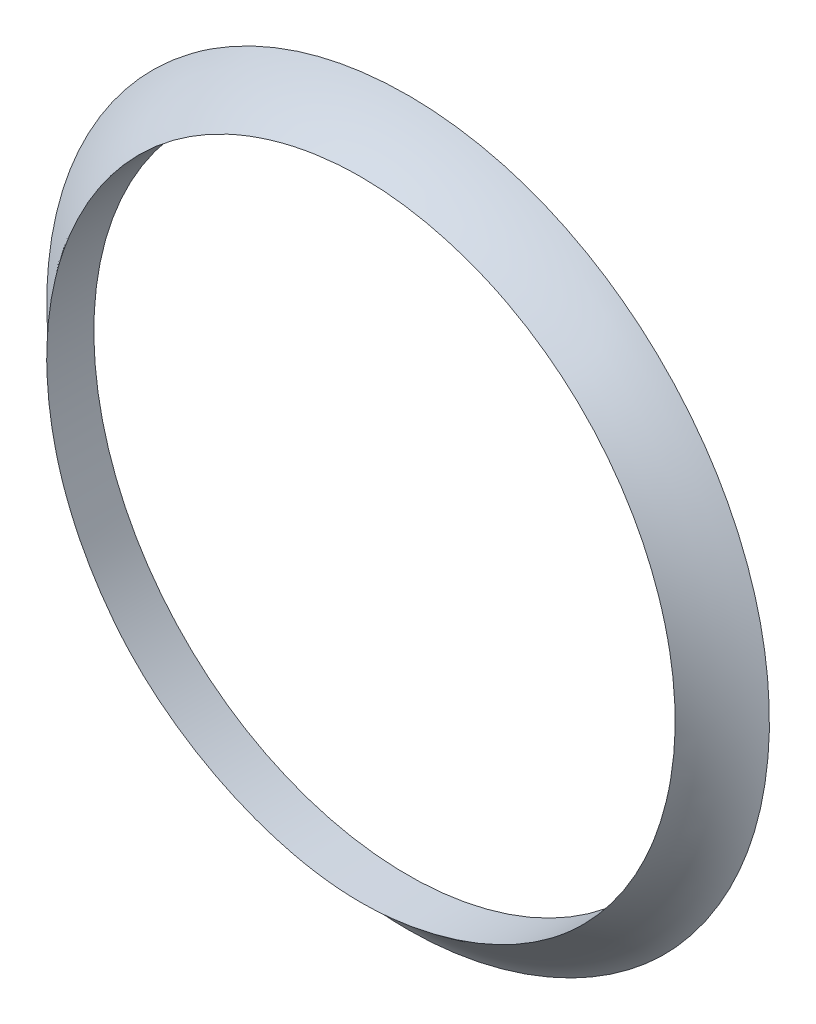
ISO-10303-21;
HEADER;
FILE_DESCRIPTION(('STEP AP214'),'2;1');
FILE_NAME('part.step','',(''),(''),'','','');
FILE_SCHEMA(('AUTOMOTIVE_DESIGN { 1 0 10303 214 1 1 1 1 }'));
ENDSEC;
DATA;
#1=APPLICATION_CONTEXT('core data for automotive mechanical design processes');
#2=APPLICATION_PROTOCOL_DEFINITION('international standard','automotive_design',2000,#1);
#3=PRODUCT_CONTEXT('',#1,'mechanical');
#4=PRODUCT('Part','Part','',(#3));
#5=PRODUCT_RELATED_PRODUCT_CATEGORY('part','',(#4));
#6=PRODUCT_DEFINITION_FORMATION('','',#4);
#7=PRODUCT_DEFINITION_CONTEXT('part definition',#1,'design');
#8=PRODUCT_DEFINITION('design','',#6,#7);
#9=PRODUCT_DEFINITION_SHAPE('','',#8);
#10=(LENGTH_UNIT() NAMED_UNIT(*) SI_UNIT(.MILLI.,.METRE.));
#11=(NAMED_UNIT(*) PLANE_ANGLE_UNIT() SI_UNIT($,.RADIAN.));
#12=(NAMED_UNIT(*) SI_UNIT($,.STERADIAN.) SOLID_ANGLE_UNIT());
#13=UNCERTAINTY_MEASURE_WITH_UNIT(LENGTH_MEASURE(1.E-05),#10,'distance_accuracy_value','');
#14=(GEOMETRIC_REPRESENTATION_CONTEXT(3) GLOBAL_UNCERTAINTY_ASSIGNED_CONTEXT((#13)) GLOBAL_UNIT_ASSIGNED_CONTEXT((#10,
#11,#12)) REPRESENTATION_CONTEXT('',''));
#15=CARTESIAN_POINT('',(0.,0.,0.));
#16=DIRECTION('',(0.,0.,1.));
#17=DIRECTION('',(1.,0.,0.));
#18=AXIS2_PLACEMENT_3D('',#15,#16,#17);
#19=CARTESIAN_POINT('',(370.257977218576,-413.045415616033,-97.4999999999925));
#20=DIRECTION('',(0.,0.,-1.));
#21=DIRECTION('',(0.325224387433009,0.945636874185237,0.));
#22=AXIS2_PLACEMENT_3D('',#19,#20,#21);
#23=PLANE('',#22);
#24=CARTESIAN_POINT('',(324.15171112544,-462.488037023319,-97.4999999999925));
#25=CARTESIAN_POINT('',(324.774505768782,-462.488044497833,-97.4999999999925));
#26=CARTESIAN_POINT('',(325.397181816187,-462.46055033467,-97.4999999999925));
#27=CARTESIAN_POINT('',(326.638158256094,-462.352873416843,-97.4999999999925));
#28=CARTESIAN_POINT('',(327.256457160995,-462.2726735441,-97.4999999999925));
#29=CARTESIAN_POINT('',(328.485669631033,-462.061692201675,-97.4999999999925));
#30=CARTESIAN_POINT('',(329.096564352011,-461.930801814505,-97.4999999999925));
#31=CARTESIAN_POINT('',(330.305931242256,-461.620688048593,-97.4999999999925));
#32=CARTESIAN_POINT('',(330.904404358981,-461.441468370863,-97.4999999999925));
#33=CARTESIAN_POINT('',(331.88731483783,-461.104638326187,-97.4999999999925));
#34=CARTESIAN_POINT('',(332.276233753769,-460.959931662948,-97.4999999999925));
#35=CARTESIAN_POINT('',(333.046086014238,-460.650590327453,-97.4999999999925));
#36=CARTESIAN_POINT('',(333.427019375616,-460.485955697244,-97.4999999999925));
#37=CARTESIAN_POINT('',(334.179879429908,-460.137249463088,-97.4999999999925));
#38=CARTESIAN_POINT('',(334.551806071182,-459.953177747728,-97.4999999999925));
#39=CARTESIAN_POINT('',(335.285228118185,-459.566250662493,-97.4999999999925));
#40=CARTESIAN_POINT('',(335.646734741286,-459.363416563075,-97.4999999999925));
#41=CARTESIAN_POINT('',(336.358696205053,-458.939187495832,-97.4999999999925));
#42=CARTESIAN_POINT('',(336.709150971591,-458.717792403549,-97.4999999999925));
#43=CARTESIAN_POINT('',(337.397929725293,-458.256790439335,-97.4999999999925));
#44=CARTESIAN_POINT('',(337.736252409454,-458.017181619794,-97.4999999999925));
#45=CARTESIAN_POINT('',(338.426527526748,-457.499907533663,-97.4999999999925));
#46=CARTESIAN_POINT('',(338.777349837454,-457.220732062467,-97.4999999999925));
#47=CARTESIAN_POINT('',(339.461793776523,-456.641970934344,-97.4999999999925));
#48=CARTESIAN_POINT('',(339.795415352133,-456.342385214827,-97.4999999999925));
#49=CARTESIAN_POINT('',(340.281537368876,-455.878135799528,-97.4999999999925));
#50=CARTESIAN_POINT('',(340.441192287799,-455.720908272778,-97.4999999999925));
#51=CARTESIAN_POINT('',(340.75556056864,-455.401588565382,-97.4999999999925));
#52=CARTESIAN_POINT('',(340.910273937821,-455.239496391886,-97.4999999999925));
#53=CARTESIAN_POINT('',(341.366987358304,-454.746075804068,-97.4999999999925));
#54=CARTESIAN_POINT('',(341.661444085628,-454.4077147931,-97.4999999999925));
#55=CARTESIAN_POINT('',(342.229559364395,-453.713892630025,-97.4999999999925));
#56=CARTESIAN_POINT('',(342.503214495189,-453.358428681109,-97.4999999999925));
#57=CARTESIAN_POINT('',(342.897776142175,-452.81377200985,-97.4999999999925));
#58=CARTESIAN_POINT('',(343.026647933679,-452.630302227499,-97.4999999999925));
#59=CARTESIAN_POINT('',(343.279113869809,-452.259713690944,-97.4999999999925));
#60=CARTESIAN_POINT('',(343.402706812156,-452.072594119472,-97.4999999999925));
#61=CARTESIAN_POINT('',(343.864534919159,-451.35113044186,-97.4999999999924));
#62=CARTESIAN_POINT('',(344.184059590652,-450.804610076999,-97.4999999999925));
#63=CARTESIAN_POINT('',(344.777451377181,-449.687359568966,-97.4999999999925));
#64=CARTESIAN_POINT('',(345.051315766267,-449.116627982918,-97.4999999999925));
#65=CARTESIAN_POINT('',(345.550661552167,-447.954617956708,-97.4999999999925));
#66=CARTESIAN_POINT('',(345.776162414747,-447.363347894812,-97.4999999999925));
#67=CARTESIAN_POINT('',(346.176690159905,-446.163824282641,-97.4999999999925));
#68=CARTESIAN_POINT('',(346.351713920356,-445.555569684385,-97.4999999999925));
#69=CARTESIAN_POINT('',(346.576907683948,-444.628271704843,-97.4999999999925));
#70=CARTESIAN_POINT('',(346.646203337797,-444.313750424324,-97.4999999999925));
#71=CARTESIAN_POINT('',(346.771433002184,-443.682041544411,-97.4999999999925));
#72=CARTESIAN_POINT('',(346.827367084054,-443.364853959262,-97.4999999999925));
#73=CARTESIAN_POINT('',(346.926006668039,-442.728428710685,-97.4999999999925));
#74=CARTESIAN_POINT('',(346.968711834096,-442.409190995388,-97.4999999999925));
#75=CARTESIAN_POINT('',(347.040906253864,-441.769221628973,-97.4999999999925));
#76=CARTESIAN_POINT('',(347.070395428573,-441.448489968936,-97.4999999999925));
#77=CARTESIAN_POINT('',(347.116099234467,-440.805966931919,-97.4999999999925));
#78=CARTESIAN_POINT('',(347.132309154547,-440.484175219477,-97.4999999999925));
#79=CARTESIAN_POINT('',(347.151231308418,-439.840197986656,-97.4999999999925));
#80=CARTESIAN_POINT('',(347.153943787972,-439.518012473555,-97.4999999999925));
#81=CARTESIAN_POINT('',(347.145761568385,-438.873812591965,-97.4999999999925));
#82=CARTESIAN_POINT('',(347.134866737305,-438.551798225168,-97.4999999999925));
#83=CARTESIAN_POINT('',(347.099727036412,-437.90849366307,-97.4999999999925));
#84=CARTESIAN_POINT('',(347.075481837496,-437.587203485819,-97.4999999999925));
#85=CARTESIAN_POINT('',(347.013431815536,-436.942769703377,-97.4999999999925));
#86=CARTESIAN_POINT('',(346.975496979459,-436.619638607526,-97.4999999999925));
#87=CARTESIAN_POINT('',(346.886134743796,-435.975251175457,-97.4999999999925));
#88=CARTESIAN_POINT('',(346.834707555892,-435.653994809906,-97.4999999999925));
#89=CARTESIAN_POINT('',(346.718248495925,-435.013971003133,-97.4999999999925));
#90=CARTESIAN_POINT('',(346.653217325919,-434.695203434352,-97.4999999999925));
#91=CARTESIAN_POINT('',(346.509473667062,-434.060761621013,-97.4999999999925));
#92=CARTESIAN_POINT('',(346.430760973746,-433.745087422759,-97.4999999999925));
#93=CARTESIAN_POINT('',(346.259810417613,-433.117535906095,-97.4999999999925));
#94=CARTESIAN_POINT('',(346.167577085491,-432.805657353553,-97.4999999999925));
#95=CARTESIAN_POINT('',(345.969749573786,-432.186166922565,-97.4999999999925));
#96=CARTESIAN_POINT('',(345.864155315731,-431.87855506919,-97.4999999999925));
#97=CARTESIAN_POINT('',(345.639873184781,-431.268162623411,-97.4999999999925));
#98=CARTESIAN_POINT('',(345.521186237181,-430.965381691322,-97.4999999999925));
#99=CARTESIAN_POINT('',(345.271037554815,-430.365079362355,-97.4999999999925));
#100=CARTESIAN_POINT('',(345.13957260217,-430.067559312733,-97.4999999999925));
#101=CARTESIAN_POINT('',(344.729710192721,-429.190764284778,-97.4999999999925));
#102=CARTESIAN_POINT('',(344.433120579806,-428.619862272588,-97.4999999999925));
#103=CARTESIAN_POINT('',(343.793301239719,-427.504912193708,-97.4999999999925));
#104=CARTESIAN_POINT('',(343.450071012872,-426.960864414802,-97.4999999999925));
#105=CARTESIAN_POINT('',(342.719167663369,-425.903219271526,-97.4999999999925));
#106=CARTESIAN_POINT('',(342.3314810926,-425.389631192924,-97.4999999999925));
#107=CARTESIAN_POINT('',(341.514657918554,-424.396530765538,-97.4999999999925));
#108=CARTESIAN_POINT('',(341.085519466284,-423.917019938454,-97.4999999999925));
#109=CARTESIAN_POINT('',(340.184881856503,-422.991121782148,-97.4999999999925));
#110=CARTESIAN_POINT('',(339.713036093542,-422.545071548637,-97.4999999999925));
#111=CARTESIAN_POINT('',(338.733575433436,-421.69415592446,-97.4999999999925));
#112=CARTESIAN_POINT('',(338.225961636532,-421.289289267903,-97.4999999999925));
#113=CARTESIAN_POINT('',(337.178554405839,-420.523946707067,-97.4999999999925));
#114=CARTESIAN_POINT('',(336.638770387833,-420.163457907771,-97.4999999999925));
#115=CARTESIAN_POINT('',(335.530600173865,-419.489260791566,-97.4999999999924));
#116=CARTESIAN_POINT('',(334.962212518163,-419.175554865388,-97.4999999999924));
#117=CARTESIAN_POINT('',(334.0910840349,-418.741671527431,-97.4999999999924));
#118=CARTESIAN_POINT('',(333.797383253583,-418.603063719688,-97.4999999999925));
#119=CARTESIAN_POINT('',(333.204364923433,-418.338390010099,-97.4999999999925));
#120=CARTESIAN_POINT('',(332.905047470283,-418.212323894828,-97.4999999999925));
#121=CARTESIAN_POINT('',(332.301337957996,-417.973065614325,-97.4999999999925));
#122=CARTESIAN_POINT('',(331.996946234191,-417.859872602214,-97.4999999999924));
#123=CARTESIAN_POINT('',(331.383579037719,-417.646663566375,-97.4999999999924));
#124=CARTESIAN_POINT('',(331.074603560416,-417.546647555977,-97.4999999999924));
#125=CARTESIAN_POINT('',(330.452575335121,-417.360007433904,-97.4999999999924));
#126=CARTESIAN_POINT('',(330.139521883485,-417.27338566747,-97.4999999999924));
#127=CARTESIAN_POINT('',(329.509937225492,-417.113701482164,-97.4999999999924));
#128=CARTESIAN_POINT('',(329.193405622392,-417.040640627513,-97.4999999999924));
#129=CARTESIAN_POINT('',(328.557484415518,-416.908162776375,-97.4999999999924));
#130=CARTESIAN_POINT('',(328.238094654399,-416.848746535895,-97.4999999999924));
#131=CARTESIAN_POINT('',(327.59713389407,-416.743420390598,-97.4999999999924));
#132=CARTESIAN_POINT('',(327.275563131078,-416.697509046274,-97.4999999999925));
#133=CARTESIAN_POINT('',(326.634565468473,-416.619594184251,-97.4999999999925));
#134=CARTESIAN_POINT('',(326.31515758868,-416.587434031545,-97.4999999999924));
#135=CARTESIAN_POINT('',(325.675292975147,-416.536297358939,-97.4999999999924));
#136=CARTESIAN_POINT('',(325.354836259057,-416.517320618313,-97.4999999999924));
#137=CARTESIAN_POINT('',(324.713411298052,-416.492700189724,-97.4999999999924));
#138=CARTESIAN_POINT('',(324.392443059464,-416.4870563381,-97.4999999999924));
#139=CARTESIAN_POINT('',(323.750555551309,-416.48929948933,-97.4999999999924));
#140=CARTESIAN_POINT('',(323.429636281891,-416.497186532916,-97.4999999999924));
#141=CARTESIAN_POINT('',(322.788445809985,-416.526249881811,-97.4999999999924));
#142=CARTESIAN_POINT('',(322.468174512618,-416.547424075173,-97.4999999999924));
#143=CARTESIAN_POINT('',(321.828803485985,-416.602937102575,-97.4999999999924));
#144=CARTESIAN_POINT('',(321.509703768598,-416.637276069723,-97.4999999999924));
#145=CARTESIAN_POINT('',(320.554907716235,-416.759983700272,-97.4999999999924));
#146=CARTESIAN_POINT('',(319.921563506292,-416.868049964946,-97.4999999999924));
#147=CARTESIAN_POINT('',(318.975355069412,-417.07112018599,-97.4999999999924));
#148=CARTESIAN_POINT('',(318.658100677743,-417.146399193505,-97.4999999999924));
#149=CARTESIAN_POINT('',(318.027152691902,-417.310610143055,-97.4999999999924));
#150=CARTESIAN_POINT('',(317.713458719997,-417.399540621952,-97.4999999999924));
#151=CARTESIAN_POINT('',(317.090187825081,-417.590894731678,-97.4999999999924));
#152=CARTESIAN_POINT('',(316.780611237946,-417.693319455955,-97.4999999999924));
#153=CARTESIAN_POINT('',(316.166178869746,-417.911405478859,-97.4999999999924));
#154=CARTESIAN_POINT('',(315.861323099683,-418.027066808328,-97.4999999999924));
#155=CARTESIAN_POINT('',(314.954601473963,-418.393401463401,-97.4999999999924));
#156=CARTESIAN_POINT('',(314.36043849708,-418.663469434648,-97.4999999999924));
#157=CARTESIAN_POINT('',(313.197226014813,-419.252946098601,-97.4999999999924));
#158=CARTESIAN_POINT('',(312.628176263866,-419.572354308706,-97.4999999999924));
#159=CARTESIAN_POINT('',(311.527903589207,-420.252939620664,-97.4999999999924));
#160=CARTESIAN_POINT('',(310.996227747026,-420.61338402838,-97.4999999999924));
#161=CARTESIAN_POINT('',(309.964818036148,-421.377369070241,-97.4999999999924));
#162=CARTESIAN_POINT('',(309.465083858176,-421.780909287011,-97.4999999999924));
#163=CARTESIAN_POINT('',(308.500783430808,-422.628128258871,-97.4999999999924));
#164=CARTESIAN_POINT('',(308.036221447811,-423.071811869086,-97.4999999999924));
#165=CARTESIAN_POINT('',(307.145466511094,-423.996149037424,-97.4999999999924));
#166=CARTESIAN_POINT('',(306.719273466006,-424.476802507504,-97.4999999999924));
#167=CARTESIAN_POINT('',(305.903073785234,-425.478388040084,-97.4999999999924));
#168=CARTESIAN_POINT('',(305.513609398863,-425.999762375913,-97.4999999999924));
#169=CARTESIAN_POINT('',(304.78021257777,-427.073609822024,-97.4999999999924));
#170=CARTESIAN_POINT('',(304.436281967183,-427.626084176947,-97.4999999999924));
#171=CARTESIAN_POINT('',(303.796402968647,-428.758078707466,-97.4999999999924));
#172=CARTESIAN_POINT('',(303.500443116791,-429.337592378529,-97.4999999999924));
#173=CARTESIAN_POINT('',(303.094144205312,-430.223898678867,-97.4999999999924));
#174=CARTESIAN_POINT('',(302.964976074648,-430.522197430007,-97.4999999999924));
#175=CARTESIAN_POINT('',(302.719429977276,-431.124046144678,-97.4999999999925));
#176=CARTESIAN_POINT('',(302.603052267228,-431.427596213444,-97.4999999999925));
#177=CARTESIAN_POINT('',(302.383968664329,-432.037934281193,-97.4999999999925));
#178=CARTESIAN_POINT('',(302.281199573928,-432.344699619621,-97.4999999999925));
#179=CARTESIAN_POINT('',(302.088927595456,-432.962329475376,-97.4999999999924));
#180=CARTESIAN_POINT('',(301.999423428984,-433.273193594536,-97.4999999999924));
#181=CARTESIAN_POINT('',(301.833831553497,-433.898503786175,-97.4999999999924));
#182=CARTESIAN_POINT('',(301.757745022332,-434.212950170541,-97.4999999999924));
#183=CARTESIAN_POINT('',(301.619107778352,-434.844811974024,-97.4999999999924));
#184=CARTESIAN_POINT('',(301.556557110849,-435.162227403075,-97.4999999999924));
#185=CARTESIAN_POINT('',(301.444874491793,-435.799462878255,-97.4999999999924));
#186=CARTESIAN_POINT('',(301.395744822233,-436.119283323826,-97.4999999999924));
#187=CARTESIAN_POINT('',(301.310828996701,-436.760691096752,-97.4999999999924));
#188=CARTESIAN_POINT('',(301.275042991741,-437.082278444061,-97.4999999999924));
#189=CARTESIAN_POINT('',(301.216851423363,-437.726664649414,-97.4999999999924));
#190=CARTESIAN_POINT('',(301.194445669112,-438.049463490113,-97.4999999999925));
#191=CARTESIAN_POINT('',(301.163124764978,-438.695681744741,-97.4999999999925));
#192=CARTESIAN_POINT('',(301.154209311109,-439.019101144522,-97.4999999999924));
#193=CARTESIAN_POINT('',(301.14810506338,-439.987446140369,-97.4999999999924));
#194=CARTESIAN_POINT('',(301.171357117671,-440.632663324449,-97.4999999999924));
#195=CARTESIAN_POINT('',(301.24613002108,-441.59712317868,-97.4999999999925));
#196=CARTESIAN_POINT('',(301.277710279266,-441.918091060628,-97.4999999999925));
#197=CARTESIAN_POINT('',(301.354120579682,-442.558475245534,-97.4999999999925));
#198=CARTESIAN_POINT('',(301.398950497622,-442.877891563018,-97.4999999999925));
#199=CARTESIAN_POINT('',(301.501892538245,-443.514578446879,-97.4999999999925));
#200=CARTESIAN_POINT('',(301.560004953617,-443.831848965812,-97.4999999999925));
#201=CARTESIAN_POINT('',(301.689656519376,-444.463642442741,-97.4999999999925));
#202=CARTESIAN_POINT('',(301.761195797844,-444.778165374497,-97.4999999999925));
#203=CARTESIAN_POINT('',(301.917656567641,-445.403820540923,-97.4999999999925));
#204=CARTESIAN_POINT('',(302.002576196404,-445.714953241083,-97.4999999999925));
#205=CARTESIAN_POINT('',(302.185680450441,-446.333293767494,-97.4999999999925));
#206=CARTESIAN_POINT('',(302.283865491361,-446.640501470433,-97.4999999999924));
#207=CARTESIAN_POINT('',(302.528349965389,-447.352471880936,-97.4999999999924));
#208=CARTESIAN_POINT('',(302.679757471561,-447.75549170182,-97.4999999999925));
#209=CARTESIAN_POINT('',(303.005191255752,-448.552321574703,-97.4999999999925));
#210=CARTESIAN_POINT('',(303.179219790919,-448.946130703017,-97.4999999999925));
#211=CARTESIAN_POINT('',(303.549074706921,-449.723417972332,-97.4999999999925));
#212=CARTESIAN_POINT('',(303.744903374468,-450.106895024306,-97.4999999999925));
#213=CARTESIAN_POINT('',(304.157461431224,-450.862292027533,-97.4999999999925));
#214=CARTESIAN_POINT('',(304.374183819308,-451.234215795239,-97.4999999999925));
#215=CARTESIAN_POINT('',(304.714332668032,-451.782686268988,-97.4999999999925));
#216=CARTESIAN_POINT('',(304.830228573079,-451.963943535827,-97.4999999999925));
#217=CARTESIAN_POINT('',(305.066940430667,-452.323216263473,-97.4999999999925));
#218=CARTESIAN_POINT('',(305.187756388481,-452.501231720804,-97.4999999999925));
#219=CARTESIAN_POINT('',(305.557516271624,-453.030138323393,-97.4999999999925));
#220=CARTESIAN_POINT('',(305.81380429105,-453.375941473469,-97.4999999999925));
#221=CARTESIAN_POINT('',(306.34747010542,-454.054602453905,-97.4999999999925));
#222=CARTESIAN_POINT('',(306.624977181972,-454.387358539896,-97.4999999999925));
#223=CARTESIAN_POINT('',(307.199080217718,-455.03598726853,-97.4999999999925));
#224=CARTESIAN_POINT('',(307.495675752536,-455.351860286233,-97.4999999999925));
#225=CARTESIAN_POINT('',(308.10722967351,-455.965265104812,-97.4999999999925));
#226=CARTESIAN_POINT('',(308.422187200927,-456.262797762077,-97.4999999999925));
#227=CARTESIAN_POINT('',(309.068964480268,-456.83907299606,-97.4999999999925));
#228=CARTESIAN_POINT('',(309.400788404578,-457.117810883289,-97.4999999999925));
#229=CARTESIAN_POINT('',(310.079753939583,-457.656037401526,-97.4999999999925));
#230=CARTESIAN_POINT('',(310.426897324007,-457.915523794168,-97.4999999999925));
#231=CARTESIAN_POINT('',(311.135051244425,-458.414788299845,-97.4999999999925));
#232=CARTESIAN_POINT('',(311.496062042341,-458.65456604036,-97.4999999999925));
#233=CARTESIAN_POINT('',(312.3999447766,-459.21988171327,-97.4999999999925));
#234=CARTESIAN_POINT('',(312.949984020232,-459.534043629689,-97.4999999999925));
#235=CARTESIAN_POINT('',(314.073036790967,-460.118005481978,-97.4999999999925));
#236=CARTESIAN_POINT('',(314.646049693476,-460.387806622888,-97.4999999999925));
#237=CARTESIAN_POINT('',(315.811270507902,-460.881360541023,-97.4999999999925));
#238=CARTESIAN_POINT('',(316.40346850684,-461.105136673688,-97.4999999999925));
#239=CARTESIAN_POINT('',(317.603610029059,-461.504874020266,-97.4999999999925));
#240=CARTESIAN_POINT('',(318.211550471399,-461.680844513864,-97.4999999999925));
#241=CARTESIAN_POINT('',(319.6965804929,-462.046077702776,-97.4999999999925));
#242=CARTESIAN_POINT('',(320.580004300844,-462.210179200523,-97.4999999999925));
#243=CARTESIAN_POINT('',(322.359612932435,-462.431102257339,-97.4999999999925));
#244=CARTESIAN_POINT('',(323.255784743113,-462.488026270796,-97.4999999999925));
#245=CARTESIAN_POINT('',(324.15171112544,-462.488037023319,-97.4999999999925));
#246=B_SPLINE_CURVE_WITH_KNOTS('',3,(#24,#25,#26,#27,#28,#29,#30,#31,#32,#33,#34,#35,#36,#37,
#38,#39,#40,#41,#42,#43,#44,#45,#46,#47,#48,#49,#50,#51,#52,#53,#54,#55,#56,#57,#58,#59,#60,#61,
#62,#63,#64,#65,#66,#67,#68,#69,#70,#71,#72,#73,#74,#75,#76,#77,#78,#79,#80,#81,#82,#83,#84,#85,
#86,#87,#88,#89,#90,#91,#92,#93,#94,#95,#96,#97,#98,#99,#100,#101,#102,#103,#104,#105,#106,#107,
#108,#109,#110,#111,#112,#113,#114,#115,#116,#117,#118,#119,#120,#121,#122,#123,#124,#125,#126,
#127,#128,#129,#130,#131,#132,#133,#134,#135,#136,#137,#138,#139,#140,#141,#142,#143,#144,#145,
#146,#147,#148,#149,#150,#151,#152,#153,#154,#155,#156,#157,#158,#159,#160,#161,#162,#163,#164,
#165,#166,#167,#168,#169,#170,#171,#172,#173,#174,#175,#176,#177,#178,#179,#180,#181,#182,#183,
#184,#185,#186,#187,#188,#189,#190,#191,#192,#193,#194,#195,#196,#197,#198,#199,#200,#201,#202,
#203,#204,#205,#206,#207,#208,#209,#210,#211,#212,#213,#214,#215,#216,#217,#218,#219,#220,#221,
#222,#223,#224,#225,#226,#227,#228,#229,#230,#231,#232,#233,#234,#235,#236,#237,#238,#239,#240,
#241,#242,#243,#244,#245),.UNSPECIFIED.,.T.,.F.,(4,2,2,2,2,2,2,2,2,2,2,2,2,2,2,2,2,2,2,2,2,2,2,
2,2,2,2,2,2,2,2,2,2,2,2,2,2,2,2,2,2,2,2,2,2,2,2,2,2,2,2,2,2,2,2,2,2,2,2,2,2,2,2,2,2,2,2,2,2,2,2,
2,2,2,2,2,2,2,2,2,2,2,2,2,2,2,2,2,2,2,2,2,2,2,2,2,2,2,2,2,2,2,2,2,2,2,2,2,2,2,4),(0.,
1.867629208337,3.73586529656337,5.60813809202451,7.48026755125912,8.72466558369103,
9.96906099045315,11.2134635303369,12.4564722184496,13.6994892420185,14.9426393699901,
16.2869180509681,17.6312008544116,18.3033361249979,18.9754704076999,20.3202221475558,
21.6651945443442,22.3377335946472,23.0104250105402,24.9073292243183,26.8043466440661,
28.7005990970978,30.5969688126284,31.5629220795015,32.528870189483,33.4948428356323,
34.460821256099,35.4271422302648,36.3934456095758,37.3597583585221,38.3260949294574,
39.301861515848,40.2776127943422,41.2533137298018,42.2290292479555,43.2044185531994,
44.1798135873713,45.1551397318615,46.1307121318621,48.058297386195,49.9859032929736,
51.9140938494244,53.8423704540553,55.788008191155,57.733586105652,59.6785973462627,
61.623707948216,62.5977653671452,63.571806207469,64.5457829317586,65.5197606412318,
66.4939086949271,67.4681690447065,68.4424833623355,69.416693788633,70.3794909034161,
71.3422718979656,72.3050410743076,73.267813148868,74.230432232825,75.1930610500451,
77.1178665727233,78.0958194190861,79.0736675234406,80.0515949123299,81.0295245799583,
82.9849371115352,84.9403305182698,86.8650925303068,88.7898359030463,90.7148123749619,
92.6397842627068,94.5897726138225,96.5398390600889,98.4894387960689,99.4643913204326,
100.439363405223,101.409635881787,102.379814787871,103.350078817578,104.3203460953,
105.290778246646,106.261221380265,107.231650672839,108.202058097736,110.136251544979,
111.103604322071,112.070948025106,113.038313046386,114.005687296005,114.972927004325,
115.940197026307,117.231032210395,118.521996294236,119.813095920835,121.103764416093,
121.749120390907,122.394477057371,123.685007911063,124.984147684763,126.283258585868,
127.582308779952,128.881681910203,130.181205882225,131.48075441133,133.378949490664,
135.277092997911,137.174270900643,139.071080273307,141.760345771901,144.447039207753),.UNSPECIFIED.);
#247=CARTESIAN_POINT('',(324.15171112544,-462.488037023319,-97.4999999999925));
#248=VERTEX_POINT('',#247);
#249=EDGE_CURVE('E61',#248,#248,#246,.T.);
#250=ORIENTED_EDGE('',*,*,#249,.F.);
#251=EDGE_LOOP('',(#250));
#252=FACE_BOUND('',#251,.T.);
#253=CARTESIAN_POINT('',(324.151711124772,-439.488037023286,-97.4999999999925));
#254=DIRECTION('',(0.,0.,-1.));
#255=DIRECTION('',(0.,1.,0.));
#256=AXIS2_PLACEMENT_3D('',#253,#254,#255);
#257=CIRCLE('',#256,20.);
#258=CARTESIAN_POINT('',(324.151711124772,-419.488037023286,-97.4999999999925));
#259=VERTEX_POINT('',#258);
#260=EDGE_CURVE('E71',#259,#259,#257,.T.);
#261=ORIENTED_EDGE('',*,*,#260,.F.);
#262=EDGE_LOOP('',(#261));
#263=FACE_BOUND('',#262,.T.);
#264=ADVANCED_FACE('F54',(#252,#263),#23,.T.);
#265=CARTESIAN_POINT('',(324.151711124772,-439.488037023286,-152.49999999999));
#266=DIRECTION('',(0.,0.,0.999999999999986));
#267=DIRECTION('',(0.782222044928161,0.622999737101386,0.));
#268=AXIS2_PLACEMENT_3D('',#265,#266,#267);
#269=CYLINDRICAL_SURFACE('',#268,20.);
#270=ORIENTED_EDGE('',*,*,#260,.T.);
#271=EDGE_LOOP('',(#270));
#272=FACE_BOUND('',#271,.T.);
#273=CARTESIAN_POINT('',(324.151711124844,-459.488037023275,-94.4999999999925));
#274=CARTESIAN_POINT('',(323.59077840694,-459.488033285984,-94.4999989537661));
#275=CARTESIAN_POINT('',(323.029741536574,-459.464418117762,-94.5033156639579));
#276=CARTESIAN_POINT('',(321.911571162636,-459.370108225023,-94.5132380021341));
#277=CARTESIAN_POINT('',(321.354438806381,-459.299400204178,-94.51984455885));
#278=CARTESIAN_POINT('',(320.247475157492,-459.111300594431,-94.5334828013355));
#279=CARTESIAN_POINT('',(319.697652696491,-458.993857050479,-94.5405149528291));
#280=CARTESIAN_POINT('',(318.609821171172,-458.713096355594,-94.5528189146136));
#281=CARTESIAN_POINT('',(318.071811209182,-458.549782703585,-94.5580908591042));
#282=CARTESIAN_POINT('',(317.188114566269,-458.240337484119,-94.5642832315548));
#283=CARTESIAN_POINT('',(316.838040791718,-458.106592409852,-94.566068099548));
#284=CARTESIAN_POINT('',(316.14592360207,-457.819640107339,-94.5680652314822));
#285=CARTESIAN_POINT('',(315.803880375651,-457.666432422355,-94.5682774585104));
#286=CARTESIAN_POINT('',(315.12894815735,-457.341051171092,-94.5670936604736));
#287=CARTESIAN_POINT('',(314.79605913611,-457.168877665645,-94.5656976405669));
#288=CARTESIAN_POINT('',(314.140553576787,-456.806149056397,-94.561440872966));
#289=CARTESIAN_POINT('',(313.817934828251,-456.615597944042,-94.5585804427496));
#290=CARTESIAN_POINT('',(313.183914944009,-456.216686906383,-94.5517165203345));
#291=CARTESIAN_POINT('',(312.872513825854,-456.008326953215,-94.5477130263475));
#292=CARTESIAN_POINT('',(312.261906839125,-455.574454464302,-94.5390711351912));
#293=CARTESIAN_POINT('',(311.962701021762,-455.348941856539,-94.534432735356));
#294=CARTESIAN_POINT('',(311.377664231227,-454.88166442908,-94.5252258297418));
#295=CARTESIAN_POINT('',(311.091822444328,-454.639913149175,-94.5206572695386));
#296=CARTESIAN_POINT('',(310.534145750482,-454.140748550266,-94.5124749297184));
#297=CARTESIAN_POINT('',(310.262310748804,-453.883335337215,-94.5088611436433));
#298=CARTESIAN_POINT('',(309.733503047,-453.353653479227,-94.503670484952));
#299=CARTESIAN_POINT('',(309.476530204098,-453.081384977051,-94.5020935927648));
#300=CARTESIAN_POINT('',(308.978261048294,-452.522855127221,-94.5004293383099));
#301=CARTESIAN_POINT('',(308.736965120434,-452.236593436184,-94.5003420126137));
#302=CARTESIAN_POINT('',(308.270801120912,-451.650962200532,-94.5008535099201));
#303=CARTESIAN_POINT('',(308.045933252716,-451.351592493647,-94.5014523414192));
#304=CARTESIAN_POINT('',(307.721518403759,-450.893465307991,-94.5020991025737));
#305=CARTESIAN_POINT('',(307.615524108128,-450.739238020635,-94.5022727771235));
#306=CARTESIAN_POINT('',(307.407902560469,-450.42786786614,-94.502417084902));
#307=CARTESIAN_POINT('',(307.306275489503,-450.270724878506,-94.5023877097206));
#308=CARTESIAN_POINT('',(306.908449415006,-449.636209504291,-94.501923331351));
#309=CARTESIAN_POINT('',(306.630007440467,-449.147521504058,-94.5007940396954));
#310=CARTESIAN_POINT('',(306.115278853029,-448.148458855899,-94.4978864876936));
#311=CARTESIAN_POINT('',(305.878992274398,-447.638084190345,-94.49610822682));
#312=CARTESIAN_POINT('',(305.557443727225,-446.859075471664,-94.4939892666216));
#313=CARTESIAN_POINT('',(305.455731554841,-446.597134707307,-94.4933743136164));
#314=CARTESIAN_POINT('',(305.263428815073,-446.069200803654,-94.4924696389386));
#315=CARTESIAN_POINT('',(305.172838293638,-445.803207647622,-94.4921799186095));
#316=CARTESIAN_POINT('',(304.918015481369,-444.999885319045,-94.4919140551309));
#317=CARTESIAN_POINT('',(304.770683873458,-444.457096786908,-94.4925408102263));
#318=CARTESIAN_POINT('',(304.522179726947,-443.360714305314,-94.494996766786));
#319=CARTESIAN_POINT('',(304.42103468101,-442.807114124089,-94.496826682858));
#320=CARTESIAN_POINT('',(304.304561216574,-441.971932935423,-94.4987245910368));
#321=CARTESIAN_POINT('',(304.271609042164,-441.692711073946,-94.4992160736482));
#322=CARTESIAN_POINT('',(304.217500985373,-441.133108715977,-94.4998747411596));
#323=CARTESIAN_POINT('',(304.196345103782,-440.852728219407,-94.5000419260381));
#324=CARTESIAN_POINT('',(304.16587228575,-440.291329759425,-94.5001309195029));
#325=CARTESIAN_POINT('',(304.156555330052,-440.010311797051,-94.5000527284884));
#326=CARTESIAN_POINT('',(304.14977552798,-439.448131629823,-94.5000010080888));
#327=CARTESIAN_POINT('',(304.152312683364,-439.166969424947,-94.5000274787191));
#328=CARTESIAN_POINT('',(304.169236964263,-438.605001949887,-94.5000300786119));
#329=CARTESIAN_POINT('',(304.183624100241,-438.324196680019,-94.50000620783));
#330=CARTESIAN_POINT('',(304.224222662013,-437.763442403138,-94.4996670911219));
#331=CARTESIAN_POINT('',(304.250434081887,-437.483493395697,-94.4993518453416));
#332=CARTESIAN_POINT('',(304.31463583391,-436.924938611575,-94.4984188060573));
#333=CARTESIAN_POINT('',(304.352626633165,-436.646332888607,-94.4978010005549));
#334=CARTESIAN_POINT('',(304.440319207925,-436.090970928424,-94.4963984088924));
#335=CARTESIAN_POINT('',(304.490020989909,-435.814214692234,-94.4956136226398));
#336=CARTESIAN_POINT('',(304.601047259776,-435.263043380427,-94.4942409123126));
#337=CARTESIAN_POINT('',(304.662371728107,-434.988628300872,-94.4936529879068));
#338=CARTESIAN_POINT('',(304.796534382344,-434.442626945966,-94.4928138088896));
#339=CARTESIAN_POINT('',(304.869372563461,-434.171040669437,-94.4925625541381));
#340=CARTESIAN_POINT('',(305.026433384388,-433.63117951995,-94.4924114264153));
#341=CARTESIAN_POINT('',(305.110656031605,-433.362904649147,-94.4925115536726));
#342=CARTESIAN_POINT('',(305.290334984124,-432.830145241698,-94.4930141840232));
#343=CARTESIAN_POINT('',(305.385791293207,-432.565660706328,-94.4934166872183));
#344=CARTESIAN_POINT('',(305.587771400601,-432.040946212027,-94.4943844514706));
#345=CARTESIAN_POINT('',(305.694295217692,-431.780716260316,-94.4949497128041));
#346=CARTESIAN_POINT('',(305.918208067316,-431.26499477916,-94.4960796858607));
#347=CARTESIAN_POINT('',(306.035597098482,-431.009503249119,-94.496644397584));
#348=CARTESIAN_POINT('',(306.403767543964,-430.250809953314,-94.4983046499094));
#349=CARTESIAN_POINT('',(306.670596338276,-429.75527514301,-94.4993665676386));
#350=CARTESIAN_POINT('',(307.245012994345,-428.788512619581,-94.5013653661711));
#351=CARTESIAN_POINT('',(307.552600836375,-428.317284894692,-94.502302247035));
#352=CARTESIAN_POINT('',(308.206387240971,-427.40239638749,-94.5040747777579));
#353=CARTESIAN_POINT('',(308.552585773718,-426.958735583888,-94.504910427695));
#354=CARTESIAN_POINT('',(309.281123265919,-426.102158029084,-94.5060773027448));
#355=CARTESIAN_POINT('',(309.663462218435,-425.689241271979,-94.5064085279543));
#356=CARTESIAN_POINT('',(310.461580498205,-424.897064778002,-94.506349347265));
#357=CARTESIAN_POINT('',(310.877361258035,-424.517806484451,-94.505958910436));
#358=CARTESIAN_POINT('',(311.739398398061,-423.795662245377,-94.5047075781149));
#359=CARTESIAN_POINT('',(312.185654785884,-423.452776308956,-94.5038466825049));
#360=CARTESIAN_POINT('',(313.105447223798,-422.805823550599,-94.5020477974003));
#361=CARTESIAN_POINT('',(313.578983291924,-422.501756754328,-94.5011098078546));
#362=CARTESIAN_POINT('',(314.550058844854,-421.934566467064,-94.4990950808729));
#363=CARTESIAN_POINT('',(315.047598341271,-421.671442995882,-94.4980183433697));
#364=CARTESIAN_POINT('',(315.809061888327,-421.308946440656,-94.4963447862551));
#365=CARTESIAN_POINT('',(316.065438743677,-421.193467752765,-94.4957771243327));
#366=CARTESIAN_POINT('',(316.582849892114,-420.973411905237,-94.4946556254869));
#367=CARTESIAN_POINT('',(316.843884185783,-420.868834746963,-94.4941017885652));
#368=CARTESIAN_POINT('',(317.370125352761,-420.670780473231,-94.4931911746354));
#369=CARTESIAN_POINT('',(317.63533222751,-420.577303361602,-94.4928343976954));
#370=CARTESIAN_POINT('',(318.169451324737,-420.401612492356,-94.4924381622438));
#371=CARTESIAN_POINT('',(318.438363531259,-420.319398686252,-94.4923987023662));
#372=CARTESIAN_POINT('',(318.979414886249,-420.16638102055,-94.4926721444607));
#373=CARTESIAN_POINT('',(319.251554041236,-420.095577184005,-94.4929850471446));
#374=CARTESIAN_POINT('',(319.798575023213,-419.965505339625,-94.4939455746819));
#375=CARTESIAN_POINT('',(320.07345685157,-419.90623733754,-94.4945931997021));
#376=CARTESIAN_POINT('',(320.625474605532,-419.79934244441,-94.496023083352));
#377=CARTESIAN_POINT('',(320.902610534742,-419.751715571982,-94.4968053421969));
#378=CARTESIAN_POINT('',(321.458644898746,-419.668187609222,-94.4981610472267));
#379=CARTESIAN_POINT('',(321.737543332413,-419.632286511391,-94.4987344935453));
#380=CARTESIAN_POINT('',(322.296591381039,-419.572275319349,-94.4995657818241));
#381=CARTESIAN_POINT('',(322.576740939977,-419.54816470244,-94.4998236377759));
#382=CARTESIAN_POINT('',(323.137816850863,-419.511775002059,-94.500074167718));
#383=CARTESIAN_POINT('',(323.418743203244,-419.499495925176,-94.5000668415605));
#384=CARTESIAN_POINT('',(323.840315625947,-419.489967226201,-94.5000223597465));
#385=CARTESIAN_POINT('',(323.98087411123,-419.488272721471,-94.5000019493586));
#386=CARTESIAN_POINT('',(324.261995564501,-419.487847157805,-94.4999986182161));
#387=CARTESIAN_POINT('',(324.40255853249,-419.489116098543,-94.5000156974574));
#388=CARTESIAN_POINT('',(324.824157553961,-419.497368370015,-94.5000602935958));
#389=CARTESIAN_POINT('',(325.105119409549,-419.508796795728,-94.5000811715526));
#390=CARTESIAN_POINT('',(325.666302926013,-419.543487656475,-94.4998667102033));
#391=CARTESIAN_POINT('',(325.946524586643,-419.566750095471,-94.4996313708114));
#392=CARTESIAN_POINT('',(326.505738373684,-419.625066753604,-94.4988435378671));
#393=CARTESIAN_POINT('',(326.784730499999,-419.660120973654,-94.4982910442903));
#394=CARTESIAN_POINT('',(327.340994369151,-419.741961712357,-94.4969634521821));
#395=CARTESIAN_POINT('',(327.618266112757,-419.788748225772,-94.4961883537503));
#396=CARTESIAN_POINT('',(328.170566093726,-419.893959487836,-94.4947420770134));
#397=CARTESIAN_POINT('',(328.445594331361,-419.952384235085,-94.4940708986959));
#398=CARTESIAN_POINT('',(329.266641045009,-420.144994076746,-94.4925694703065));
#399=CARTESIAN_POINT('',(329.808742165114,-420.296532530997,-94.4922508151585));
#400=CARTESIAN_POINT('',(330.610660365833,-420.557608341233,-94.4927684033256));
#401=CARTESIAN_POINT('',(330.876123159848,-420.65027384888,-94.493106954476));
#402=CARTESIAN_POINT('',(331.40291496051,-420.846710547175,-94.4939921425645));
#403=CARTESIAN_POINT('',(331.664243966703,-420.950481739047,-94.4945387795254));
#404=CARTESIAN_POINT('',(332.441293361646,-421.278184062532,-94.4962084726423));
#405=CARTESIAN_POINT('',(332.950195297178,-421.518542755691,-94.4973615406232));
#406=CARTESIAN_POINT('',(333.945877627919,-422.041244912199,-94.4995036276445));
#407=CARTESIAN_POINT('',(334.432658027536,-422.32358836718,-94.5004926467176));
#408=CARTESIAN_POINT('',(335.38070874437,-422.928276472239,-94.5024150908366));
#409=CARTESIAN_POINT('',(335.841979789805,-423.250619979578,-94.5033485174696));
#410=CARTESIAN_POINT('',(336.735725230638,-423.933014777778,-94.5049723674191));
#411=CARTESIAN_POINT('',(337.168199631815,-424.293066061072,-94.5056627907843));
#412=CARTESIAN_POINT('',(338.001283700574,-425.048319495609,-94.5064137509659));
#413=CARTESIAN_POINT('',(338.401893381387,-425.443521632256,-94.5064742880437));
#414=CARTESIAN_POINT('',(339.168398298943,-426.266266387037,-94.5059240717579));
#415=CARTESIAN_POINT('',(339.534293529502,-426.693809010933,-94.5053133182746));
#416=CARTESIAN_POINT('',(340.228782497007,-427.578213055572,-94.5037782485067));
#417=CARTESIAN_POINT('',(340.557374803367,-428.035075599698,-94.5028539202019));
#418=CARTESIAN_POINT('',(341.174905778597,-428.974855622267,-94.5009607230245));
#419=CARTESIAN_POINT('',(341.463844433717,-429.457773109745,-94.4999918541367));
#420=CARTESIAN_POINT('',(342.000014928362,-430.446235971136,-94.4978978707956));
#421=CARTESIAN_POINT('',(342.247246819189,-430.951781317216,-94.4967727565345));
#422=CARTESIAN_POINT('',(342.6982415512,-431.981880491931,-94.4945008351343));
#423=CARTESIAN_POINT('',(342.902004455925,-432.50643429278,-94.4933540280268));
#424=CARTESIAN_POINT('',(343.264639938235,-433.570941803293,-94.4922853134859));
#425=CARTESIAN_POINT('',(343.423510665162,-434.110896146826,-94.492363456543));
#426=CARTESIAN_POINT('',(343.627254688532,-434.929272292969,-94.493536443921));
#427=CARTESIAN_POINT('',(343.689414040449,-435.203502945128,-94.494103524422));
#428=CARTESIAN_POINT('',(343.802122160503,-435.754359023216,-94.495453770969));
#429=CARTESIAN_POINT('',(343.852670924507,-436.030984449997,-94.4962369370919));
#430=CARTESIAN_POINT('',(343.942059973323,-436.586116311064,-94.4976573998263));
#431=CARTESIAN_POINT('',(343.980900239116,-436.864622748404,-94.4982946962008));
#432=CARTESIAN_POINT('',(344.04680526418,-437.423027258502,-94.4992697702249));
#433=CARTESIAN_POINT('',(344.073870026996,-437.70292533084,-94.4996075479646));
#434=CARTESIAN_POINT('',(344.116175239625,-438.263613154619,-94.4999871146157));
#435=CARTESIAN_POINT('',(344.131415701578,-438.544402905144,-94.500028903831));
#436=CARTESIAN_POINT('',(344.150045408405,-439.106375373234,-94.5000326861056));
#437=CARTESIAN_POINT('',(344.153434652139,-439.387558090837,-94.4999946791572));
#438=CARTESIAN_POINT('',(344.148355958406,-439.949803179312,-94.5000410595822));
#439=CARTESIAN_POINT('',(344.139888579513,-440.230865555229,-94.5001254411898));
#440=CARTESIAN_POINT('',(344.111112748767,-440.792383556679,-94.5000652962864));
#441=CARTESIAN_POINT('',(344.090804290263,-441.072839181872,-94.4999207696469));
#442=CARTESIAN_POINT('',(344.03838215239,-441.632645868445,-94.499306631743));
#443=CARTESIAN_POINT('',(344.006268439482,-441.911996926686,-94.4988370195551));
#444=CARTESIAN_POINT('',(343.930293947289,-442.469093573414,-94.4976130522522));
#445=CARTESIAN_POINT('',(343.88643321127,-442.746839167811,-94.496858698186));
#446=CARTESIAN_POINT('',(343.787039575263,-443.30024051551,-94.4953234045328));
#447=CARTESIAN_POINT('',(343.731506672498,-443.575896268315,-94.4945424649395));
#448=CARTESIAN_POINT('',(343.608877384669,-444.124603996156,-94.4932621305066));
#449=CARTESIAN_POINT('',(343.541780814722,-444.397655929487,-94.492762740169));
#450=CARTESIAN_POINT('',(343.323297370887,-445.212206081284,-94.4918365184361));
#451=CARTESIAN_POINT('',(343.154693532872,-445.749227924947,-94.4919811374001));
#452=CARTESIAN_POINT('',(342.83655885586,-446.630666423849,-94.4933964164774));
#453=CARTESIAN_POINT('',(342.699394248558,-446.97963319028,-94.4942757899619));
#454=CARTESIAN_POINT('',(342.40566048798,-447.669342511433,-94.496276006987));
#455=CARTESIAN_POINT('',(342.249091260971,-448.010085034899,-94.4973968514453));
#456=CARTESIAN_POINT('',(341.917058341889,-448.682218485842,-94.4994686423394));
#457=CARTESIAN_POINT('',(341.741594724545,-449.0136094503,-94.5004195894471));
#458=CARTESIAN_POINT('',(341.372316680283,-449.666013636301,-94.5018272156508));
#459=CARTESIAN_POINT('',(341.178503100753,-449.987027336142,-94.5022839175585));
#460=CARTESIAN_POINT('',(340.874508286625,-450.459964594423,-94.5024080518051));
#461=CARTESIAN_POINT('',(340.770958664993,-450.616187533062,-94.5023559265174));
#462=CARTESIAN_POINT('',(340.559509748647,-450.925661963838,-94.5020744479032));
#463=CARTESIAN_POINT('',(340.45161045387,-451.078913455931,-94.5018450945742));
#464=CARTESIAN_POINT('',(340.121519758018,-451.53401822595,-94.5011195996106));
#465=CARTESIAN_POINT('',(339.892914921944,-451.831253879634,-94.5005859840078));
#466=CARTESIAN_POINT('',(339.419359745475,-452.412409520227,-94.5003888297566));
#467=CARTESIAN_POINT('',(339.174409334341,-452.696329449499,-94.5007252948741));
#468=CARTESIAN_POINT('',(338.795337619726,-453.111521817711,-94.5024400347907));
#469=CARTESIAN_POINT('',(338.667032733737,-453.248144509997,-94.5032133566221));
#470=CARTESIAN_POINT('',(338.406636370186,-453.517727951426,-94.5052481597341));
#471=CARTESIAN_POINT('',(338.274544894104,-453.650688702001,-94.5065096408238));
#472=CARTESIAN_POINT('',(337.872748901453,-454.04391421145,-94.5109877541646));
#473=CARTESIAN_POINT('',(337.597499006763,-454.298548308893,-94.5148981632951));
#474=CARTESIAN_POINT('',(337.033082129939,-454.791985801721,-94.5234641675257));
#475=CARTESIAN_POINT('',(336.743911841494,-455.030785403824,-94.528119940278));
#476=CARTESIAN_POINT('',(336.152602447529,-455.491759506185,-94.5373374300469));
#477=CARTESIAN_POINT('',(335.850463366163,-455.713934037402,-94.5418991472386));
#478=CARTESIAN_POINT('',(335.234175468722,-456.140950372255,-94.5502622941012));
#479=CARTESIAN_POINT('',(334.92002688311,-456.345792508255,-94.5540637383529));
#480=CARTESIAN_POINT('',(334.280749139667,-456.737474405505,-94.5604376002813));
#481=CARTESIAN_POINT('',(333.955621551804,-456.924316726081,-94.5630101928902));
#482=CARTESIAN_POINT('',(333.295365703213,-457.279442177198,-94.566643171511));
#483=CARTESIAN_POINT('',(332.960237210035,-457.44772487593,-94.5677035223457));
#484=CARTESIAN_POINT('',(332.281030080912,-457.765200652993,-94.5682072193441));
#485=CARTESIAN_POINT('',(331.936950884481,-457.914392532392,-94.567650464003));
#486=CARTESIAN_POINT('',(331.241332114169,-458.193049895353,-94.5649895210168));
#487=CARTESIAN_POINT('',(330.889800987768,-458.322536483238,-94.5628870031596));
#488=CARTESIAN_POINT('',(330.180058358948,-458.561558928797,-94.5573730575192));
#489=CARTESIAN_POINT('',(329.821847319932,-458.671096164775,-94.553961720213));
#490=CARTESIAN_POINT('',(329.099946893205,-458.869860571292,-94.5462316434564));
#491=CARTESIAN_POINT('',(328.736259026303,-458.959093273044,-94.5419131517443));
#492=CARTESIAN_POINT('',(328.024139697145,-459.112760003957,-94.5331706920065));
#493=CARTESIAN_POINT('',(327.6759396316,-459.178269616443,-94.5287648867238));
#494=CARTESIAN_POINT('',(326.976492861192,-459.290716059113,-94.5202417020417));
#495=CARTESIAN_POINT('',(326.625245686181,-459.337649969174,-94.516124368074));
#496=CARTESIAN_POINT('',(325.92080017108,-459.412789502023,-94.5088877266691));
#497=CARTESIAN_POINT('',(325.567602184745,-459.440998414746,-94.5057682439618));
#498=CARTESIAN_POINT('',(324.860187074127,-459.478624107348,-94.5013246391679));
#499=CARTESIAN_POINT('',(324.50596987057,-459.488039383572,-94.50000066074));
#500=CARTESIAN_POINT('',(324.151711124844,-459.488037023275,-94.4999999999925));
#501=B_SPLINE_CURVE_WITH_KNOTS('',3,(#273,#274,#275,#276,#277,#278,#279,#280,#281,#282,#283,
#284,#285,#286,#287,#288,#289,#290,#291,#292,#293,#294,#295,#296,#297,#298,#299,#300,#301,#302,
#303,#304,#305,#306,#307,#308,#309,#310,#311,#312,#313,#314,#315,#316,#317,#318,#319,#320,#321,
#322,#323,#324,#325,#326,#327,#328,#329,#330,#331,#332,#333,#334,#335,#336,#337,#338,#339,#340,
#341,#342,#343,#344,#345,#346,#347,#348,#349,#350,#351,#352,#353,#354,#355,#356,#357,#358,#359,
#360,#361,#362,#363,#364,#365,#366,#367,#368,#369,#370,#371,#372,#373,#374,#375,#376,#377,#378,
#379,#380,#381,#382,#383,#384,#385,#386,#387,#388,#389,#390,#391,#392,#393,#394,#395,#396,#397,
#398,#399,#400,#401,#402,#403,#404,#405,#406,#407,#408,#409,#410,#411,#412,#413,#414,#415,#416,
#417,#418,#419,#420,#421,#422,#423,#424,#425,#426,#427,#428,#429,#430,#431,#432,#433,#434,#435,
#436,#437,#438,#439,#440,#441,#442,#443,#444,#445,#446,#447,#448,#449,#450,#451,#452,#453,#454,
#455,#456,#457,#458,#459,#460,#461,#462,#463,#464,#465,#466,#467,#468,#469,#470,#471,#472,#473,
#474,#475,#476,#477,#478,#479,#480,#481,#482,#483,#484,#485,#486,#487,#488,#489,#490,#491,#492,
#493,#494,#495,#496,#497,#498,#499,#500),.UNSPECIFIED.,.T.,.F.,(4,2,2,2,2,2,2,2,2,2,2,2,2,2,2,2,
2,2,2,2,2,2,2,2,2,2,2,2,2,2,2,2,2,2,2,2,2,2,2,2,2,2,2,2,2,2,2,2,2,2,2,2,2,2,2,2,2,2,2,2,2,2,2,2,
2,2,2,2,2,2,2,2,2,2,2,2,2,2,2,2,2,2,2,2,2,2,2,2,2,2,2,2,2,2,2,2,2,2,2,2,2,2,2,2,2,2,2,2,2,2,2,2,
2,4),(0.,1.68248513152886,3.36544550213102,5.05028203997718,6.73499009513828,7.85871906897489,
8.98247441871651,10.1062261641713,11.2297343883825,12.3532443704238,13.4767590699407,
14.5993483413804,15.7219300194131,16.8445009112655,17.967099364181,19.0897117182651,
19.6510611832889,20.2124338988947,21.8975910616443,23.5827495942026,24.4255175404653,
25.2682889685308,26.9534549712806,28.6396227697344,29.4828942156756,30.3261657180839,
31.1694358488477,32.0127061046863,32.8559771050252,33.6992476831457,34.5425517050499,
35.3858561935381,36.2291592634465,37.0724619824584,37.915765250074,38.7590688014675,
39.6023737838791,40.4456786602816,42.1319220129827,43.8181645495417,45.5044057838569,
47.1906466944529,48.8769598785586,50.5632734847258,52.2495882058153,53.9359037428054,
54.7792529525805,55.6226022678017,56.4659518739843,57.3092978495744,58.1526455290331,
58.9959936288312,59.8393430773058,60.6826919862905,61.526003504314,62.3693154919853,
62.7909946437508,63.2126737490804,64.0559849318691,64.8992963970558,65.7426079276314,
66.5859190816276,67.429230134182,69.1154875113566,69.958804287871,70.8021211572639,
72.4883801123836,74.1746387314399,75.8608491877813,77.5470593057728,79.2332687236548,
80.9194784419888,82.6057528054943,84.2920277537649,85.9783006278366,87.6645710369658,
89.3509109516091,90.1942697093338,91.0376287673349,91.8809891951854,92.7243493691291,
93.567708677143,94.4110680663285,95.2543877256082,96.097707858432,96.9410303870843,
97.784349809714,98.627669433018,99.4710025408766,101.157275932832,102.281636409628,
103.406001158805,104.530361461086,105.654669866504,106.216881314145,106.779092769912,
107.903401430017,109.027714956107,109.589927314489,110.152139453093,111.276457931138,
112.401044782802,113.525629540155,114.650192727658,115.774595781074,116.899024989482,
118.023524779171,119.146811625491,120.270020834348,121.392923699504,122.455437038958,
123.518117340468,124.580610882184,125.643189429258),.UNSPECIFIED.);
#502=CARTESIAN_POINT('',(324.151711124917,-459.488037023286,-94.5000000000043));
#503=VERTEX_POINT('',#502);
#504=EDGE_CURVE('E11',#503,#503,#501,.T.);
#505=ORIENTED_EDGE('',*,*,#504,.F.);
#506=EDGE_LOOP('',(#505));
#507=FACE_BOUND('',#506,.T.);
#508=ADVANCED_FACE('F75',(#272,#507),#269,.F.);
#509=CARTESIAN_POINT('',(324.151711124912,-459.465833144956,-94.4638477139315));
#510=CARTESIAN_POINT('',(329.39005763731,-459.465833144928,-94.4638477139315));
#511=CARTESIAN_POINT('',(335.93799077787,-456.667697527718,-94.4638477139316));
#512=CARTESIAN_POINT('',(340.811685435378,-450.727847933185,-94.4638477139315));
#513=CARTESIAN_POINT('',(342.672487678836,-447.318083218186,-94.4638477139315));
#514=CARTESIAN_POINT('',(343.849512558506,-443.56660523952,-94.4638477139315));
#515=CARTESIAN_POINT('',(344.269444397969,-439.488037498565,-94.4638477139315));
#516=CARTESIAN_POINT('',(343.849753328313,-435.409466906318,-94.4638477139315));
#517=CARTESIAN_POINT('',(342.671524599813,-431.657997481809,-94.4638477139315));
#518=CARTESIAN_POINT('',(340.815296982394,-428.248201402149,-94.4638477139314));
#519=CARTESIAN_POINT('',(338.361354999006,-425.278393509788,-94.4638477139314));
#520=CARTESIAN_POINT('',(335.391546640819,-422.824449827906,-94.4638477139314));
#521=CARTESIAN_POINT('',(331.981750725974,-420.968228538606,-94.4638477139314));
#522=CARTESIAN_POINT('',(328.230281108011,-419.789976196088,-94.4638477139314));
#523=CARTESIAN_POINT('',(324.151711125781,-419.370373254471,-94.4638477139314));
#524=CARTESIAN_POINT('',(320.073141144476,-419.789976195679,-94.4638477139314));
#525=CARTESIAN_POINT('',(316.32167152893,-420.968228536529,-94.4638477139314));
#526=CARTESIAN_POINT('',(312.911875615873,-422.824449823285,-94.4638477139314));
#527=CARTESIAN_POINT('',(309.942067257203,-425.278393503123,-94.4638477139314));
#528=CARTESIAN_POINT('',(307.488125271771,-428.248201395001,-94.4638477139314));
#529=CARTESIAN_POINT('',(305.631897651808,-431.65799747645,-94.4638477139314));
#530=CARTESIAN_POINT('',(304.453668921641,-435.409466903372,-94.4638477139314));
#531=CARTESIAN_POINT('',(304.033977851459,-439.488037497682,-94.4638477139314));
#532=CARTESIAN_POINT('',(304.45390969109,-443.566605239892,-94.4638477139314));
#533=CARTESIAN_POINT('',(305.630934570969,-447.318083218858,-94.4638477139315));
#534=CARTESIAN_POINT('',(307.491736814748,-450.727847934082,-94.4638477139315));
#535=CARTESIAN_POINT('',(312.365431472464,-456.66769752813,-94.4638477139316));
#536=CARTESIAN_POINT('',(318.913364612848,-459.465833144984,-94.4638477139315));
#537=CARTESIAN_POINT('',(324.151711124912,-459.465833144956,-94.4638477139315));
#538=CARTESIAN_POINT('',(324.151711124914,-459.47323443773,-94.4758984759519));
#539=CARTESIAN_POINT('',(329.392000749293,-459.473234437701,-94.4758984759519));
#540=CARTESIAN_POINT('',(335.942362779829,-456.674050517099,-94.4758984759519));
#541=CARTESIAN_POINT('',(340.817852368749,-450.732020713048,-94.4758984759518));
#542=CARTESIAN_POINT('',(342.679345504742,-447.321001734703,-94.4758984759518));
#543=CARTESIAN_POINT('',(343.856808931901,-443.568136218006,-94.4758984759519));
#544=CARTESIAN_POINT('',(344.276898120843,-439.488037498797,-94.4758984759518));
#545=CARTESIAN_POINT('',(343.857049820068,-435.407935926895,-94.4758984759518));
#546=CARTESIAN_POINT('',(342.678381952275,-431.655078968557,-94.4758984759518));
#547=CARTESIAN_POINT('',(340.821465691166,-428.244028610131,-94.4758984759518));
#548=CARTESIAN_POINT('',(338.366617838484,-425.273130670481,-94.4758984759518));
#549=CARTESIAN_POINT('',(335.395719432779,-422.818281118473,-94.4758984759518));
#550=CARTESIAN_POINT('',(331.98466923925,-420.961371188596,-94.4758984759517));
#551=CARTESIAN_POINT('',(328.231812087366,-419.782679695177,-94.4758984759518));
#552=CARTESIAN_POINT('',(324.151711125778,-419.362919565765,-94.4758984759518));
#553=CARTESIAN_POINT('',(320.071610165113,-419.782679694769,-94.4758984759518));
#554=CARTESIAN_POINT('',(316.318753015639,-420.961371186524,-94.4758984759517));
#555=CARTESIAN_POINT('',(312.907702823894,-422.818281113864,-94.4758984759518));
#556=CARTESIAN_POINT('',(309.936804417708,-425.273130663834,-94.4758984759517));
#557=CARTESIAN_POINT('',(307.481956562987,-428.244028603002,-94.4758984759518));
#558=CARTESIAN_POINT('',(305.625040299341,-431.655078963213,-94.4758984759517));
#559=CARTESIAN_POINT('',(304.446372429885,-435.407935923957,-94.4758984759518));
#560=CARTESIAN_POINT('',(304.026524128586,-439.488037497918,-94.4758984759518));
#561=CARTESIAN_POINT('',(304.446613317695,-443.56813621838,-94.4758984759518));
#562=CARTESIAN_POINT('',(305.624076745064,-447.321001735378,-94.4758984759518));
#563=CARTESIAN_POINT('',(307.485569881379,-450.732020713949,-94.4758984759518));
#564=CARTESIAN_POINT('',(312.361059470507,-456.674050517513,-94.4758984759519));
#565=CARTESIAN_POINT('',(318.911421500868,-459.473234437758,-94.4758984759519));
#566=CARTESIAN_POINT('',(324.151711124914,-459.47323443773,-94.4758984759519));
#567=CARTESIAN_POINT('',(324.151711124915,-459.480635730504,-94.4879492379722));
#568=CARTESIAN_POINT('',(329.393943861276,-459.480635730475,-94.4879492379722));
#569=CARTESIAN_POINT('',(335.946734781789,-456.68040350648,-94.4879492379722));
#570=CARTESIAN_POINT('',(340.824019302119,-450.736193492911,-94.4879492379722));
#571=CARTESIAN_POINT('',(342.686203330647,-447.32392025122,-94.4879492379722));
#572=CARTESIAN_POINT('',(343.864105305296,-443.569667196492,-94.4879492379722));
#573=CARTESIAN_POINT('',(344.284351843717,-439.48803749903,-94.4879492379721));
#574=CARTESIAN_POINT('',(343.864346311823,-435.406404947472,-94.4879492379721));
#575=CARTESIAN_POINT('',(342.685239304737,-431.652160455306,-94.4879492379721));
#576=CARTESIAN_POINT('',(340.827634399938,-428.239855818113,-94.4879492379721));
#577=CARTESIAN_POINT('',(338.371880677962,-425.267867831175,-94.4879492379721));
#578=CARTESIAN_POINT('',(335.39989222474,-422.812112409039,-94.4879492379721));
#579=CARTESIAN_POINT('',(331.987587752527,-420.954513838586,-94.4879492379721));
#580=CARTESIAN_POINT('',(328.233343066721,-419.775383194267,-94.4879492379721));
#581=CARTESIAN_POINT('',(324.151711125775,-419.355465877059,-94.4879492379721));
#582=CARTESIAN_POINT('',(320.07007918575,-419.775383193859,-94.4879492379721));
#583=CARTESIAN_POINT('',(316.315834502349,-420.954513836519,-94.4879492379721));
#584=CARTESIAN_POINT('',(312.903530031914,-422.812112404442,-94.4879492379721));
#585=CARTESIAN_POINT('',(309.931541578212,-425.267867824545,-94.4879492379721));
#586=CARTESIAN_POINT('',(307.475787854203,-428.239855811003,-94.4879492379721));
#587=CARTESIAN_POINT('',(305.618182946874,-431.652160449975,-94.4879492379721));
#588=CARTESIAN_POINT('',(304.439075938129,-435.406404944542,-94.4879492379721));
#589=CARTESIAN_POINT('',(304.019070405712,-439.488037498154,-94.4879492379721));
#590=CARTESIAN_POINT('',(304.4393169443,-443.569667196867,-94.4879492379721));
#591=CARTESIAN_POINT('',(305.61721891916,-447.323920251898,-94.4879492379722));
#592=CARTESIAN_POINT('',(307.479402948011,-450.736193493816,-94.4879492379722));
#593=CARTESIAN_POINT('',(312.356687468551,-456.680403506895,-94.4879492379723));
#594=CARTESIAN_POINT('',(318.909478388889,-459.480635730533,-94.4879492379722));
#595=CARTESIAN_POINT('',(324.151711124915,-459.480635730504,-94.4879492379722));
#596=CARTESIAN_POINT('',(324.151711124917,-459.488037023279,-94.4999999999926));
#597=CARTESIAN_POINT('',(329.395886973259,-459.488037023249,-94.4999999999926));
#598=CARTESIAN_POINT('',(335.951106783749,-456.686756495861,-94.4999999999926));
#599=CARTESIAN_POINT('',(340.83018623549,-450.740366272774,-94.4999999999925));
#600=CARTESIAN_POINT('',(342.693061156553,-447.326838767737,-94.4999999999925));
#601=CARTESIAN_POINT('',(343.871401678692,-443.571198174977,-94.4999999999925));
#602=CARTESIAN_POINT('',(344.29180556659,-439.488037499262,-94.4999999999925));
#603=CARTESIAN_POINT('',(343.871642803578,-435.404873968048,-94.4999999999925));
#604=CARTESIAN_POINT('',(342.692096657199,-431.649241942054,-94.4999999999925));
#605=CARTESIAN_POINT('',(340.83380310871,-428.235683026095,-94.4999999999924));
#606=CARTESIAN_POINT('',(338.37714351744,-425.262604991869,-94.4999999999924));
#607=CARTESIAN_POINT('',(335.4040650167,-422.805943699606,-94.4999999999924));
#608=CARTESIAN_POINT('',(331.990506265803,-420.947656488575,-94.4999999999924));
#609=CARTESIAN_POINT('',(328.234874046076,-419.768086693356,-94.4999999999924));
#610=CARTESIAN_POINT('',(324.151711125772,-419.348012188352,-94.4999999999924));
#611=CARTESIAN_POINT('',(320.068548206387,-419.768086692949,-94.4999999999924));
#612=CARTESIAN_POINT('',(316.312915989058,-420.947656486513,-94.4999999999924));
#613=CARTESIAN_POINT('',(312.899357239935,-422.805943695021,-94.4999999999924));
#614=CARTESIAN_POINT('',(309.926278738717,-425.262604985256,-94.4999999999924));
#615=CARTESIAN_POINT('',(307.469619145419,-428.235683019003,-94.4999999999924));
#616=CARTESIAN_POINT('',(305.611325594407,-431.649241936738,-94.4999999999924));
#617=CARTESIAN_POINT('',(304.431779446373,-435.404873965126,-94.4999999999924));
#618=CARTESIAN_POINT('',(304.011616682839,-439.48803749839,-94.4999999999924));
#619=CARTESIAN_POINT('',(304.432020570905,-443.571198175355,-94.4999999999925));
#620=CARTESIAN_POINT('',(305.610361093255,-447.326838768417,-94.4999999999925));
#621=CARTESIAN_POINT('',(307.473236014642,-450.740366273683,-94.4999999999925));
#622=CARTESIAN_POINT('',(312.352315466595,-456.686756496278,-94.4999999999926));
#623=CARTESIAN_POINT('',(318.907535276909,-459.488037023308,-94.4999999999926));
#624=CARTESIAN_POINT('',(324.151711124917,-459.488037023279,-94.4999999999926));
#625=CARTESIAN_POINT('',(324.151711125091,-460.241936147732,-95.7274962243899));
#626=CARTESIAN_POINT('',(329.593813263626,-460.241936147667,-95.7274962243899));
#627=CARTESIAN_POINT('',(336.396440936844,-457.333874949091,-95.7274962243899));
#628=CARTESIAN_POINT('',(341.458352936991,-451.165407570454,-95.7274962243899));
#629=CARTESIAN_POINT('',(343.391602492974,-447.62412021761,-95.7274962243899));
#630=CARTESIAN_POINT('',(344.614613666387,-443.727144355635,-95.7274962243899));
#631=CARTESIAN_POINT('',(345.051045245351,-439.488037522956,-95.7274962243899));
#632=CARTESIAN_POINT('',(344.614866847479,-435.248927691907,-95.7274962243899));
#633=CARTESIAN_POINT('',(343.390589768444,-431.351960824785,-95.7274962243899));
#634=CARTESIAN_POINT('',(341.4621506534,-427.810640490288,-95.7274962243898));
#635=CARTESIAN_POINT('',(338.913218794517,-424.726529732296,-95.7274962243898));
#636=CARTESIAN_POINT('',(335.829107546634,-422.177596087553,-95.7274962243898));
#637=CARTESIAN_POINT('',(332.287787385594,-420.24916362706,-95.7274962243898));
#638=CARTESIAN_POINT('',(328.390820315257,-419.02486171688,-95.7274962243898));
#639=CARTESIAN_POINT('',(324.151711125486,-418.588775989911,-95.7274962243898));
#640=CARTESIAN_POINT('',(319.91260193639,-419.02486171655,-95.7274962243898));
#641=CARTESIAN_POINT('',(316.015634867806,-420.249163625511,-95.7274962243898));
#642=CARTESIAN_POINT('',(312.474314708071,-422.177596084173,-95.7274962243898));
#643=CARTESIAN_POINT('',(309.390203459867,-424.726529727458,-95.7274962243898));
#644=CARTESIAN_POINT('',(306.841271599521,-427.810640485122,-95.7274962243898));
#645=CARTESIAN_POINT('',(304.912832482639,-431.351960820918,-95.7274962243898));
#646=CARTESIAN_POINT('',(303.688555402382,-435.248927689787,-95.7274962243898));
#647=CARTESIAN_POINT('',(303.252377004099,-439.488037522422,-95.7274962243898));
#648=CARTESIAN_POINT('',(303.688808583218,-443.727144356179,-95.7274962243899));
#649=CARTESIAN_POINT('',(304.911819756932,-447.624120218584,-95.7274962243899));
#650=CARTESIAN_POINT('',(306.84506931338,-451.165407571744,-95.7274962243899));
#651=CARTESIAN_POINT('',(311.906981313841,-457.333874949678,-95.7274962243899));
#652=CARTESIAN_POINT('',(318.709608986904,-460.241936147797,-95.7274962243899));
#653=CARTESIAN_POINT('',(324.151711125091,-460.241936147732,-95.7274962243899));
#654=CARTESIAN_POINT('',(324.151711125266,-461.260540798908,-96.7461008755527));
#655=CARTESIAN_POINT('',(329.860881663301,-461.260540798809,-96.7461008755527));
#656=CARTESIAN_POINT('',(336.997344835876,-458.209899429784,-96.7461008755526));
#657=CARTESIAN_POINT('',(342.307831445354,-451.738424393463,-96.7461008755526));
#658=CARTESIAN_POINT('',(344.335946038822,-448.023216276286,-96.7461008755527));
#659=CARTESIAN_POINT('',(345.618951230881,-443.934947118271,-96.7461008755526));
#660=CARTESIAN_POINT('',(346.076780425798,-439.488037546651,-96.7461008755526));
#661=CARTESIAN_POINT('',(345.619216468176,-435.04112483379,-96.7461008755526));
#662=CARTESIAN_POINT('',(344.334885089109,-430.952865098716,-96.7461008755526));
#663=CARTESIAN_POINT('',(342.311810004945,-427.237622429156,-96.7461008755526));
#664=CARTESIAN_POINT('',(339.63773484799,-424.002013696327,-96.7461008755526));
#665=CARTESIAN_POINT('',(336.402125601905,-421.327936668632,-96.7461008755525));
#666=CARTESIAN_POINT('',(332.686883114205,-419.304868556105,-96.7461008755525));
#667=CARTESIAN_POINT('',(328.598623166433,-418.020511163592,-96.7461008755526));
#668=CARTESIAN_POINT('',(324.151711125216,-417.563044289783,-96.7461008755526));
#669=CARTESIAN_POINT('',(319.704799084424,-418.020511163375,-96.7461008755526));
#670=CARTESIAN_POINT('',(315.616539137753,-419.304868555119,-96.7461008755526));
#671=CARTESIAN_POINT('',(311.901296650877,-421.3279366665,-96.7461008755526));
#672=CARTESIAN_POINT('',(308.665687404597,-424.002013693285,-96.7461008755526));
#673=CARTESIAN_POINT('',(305.991612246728,-427.237622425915,-96.7461008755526));
#674=CARTESIAN_POINT('',(303.968537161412,-430.952865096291,-96.7461008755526));
#675=CARTESIAN_POINT('',(302.684205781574,-435.041124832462,-96.7461008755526));
#676=CARTESIAN_POINT('',(302.226641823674,-439.48803754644,-96.7461008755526));
#677=CARTESIAN_POINT('',(302.684471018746,-443.934947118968,-96.7461008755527));
#678=CARTESIAN_POINT('',(303.967476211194,-448.023216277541,-96.7461008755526));
#679=CARTESIAN_POINT('',(305.99559080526,-451.738424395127,-96.7461008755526));
#680=CARTESIAN_POINT('',(311.306077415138,-458.209899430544,-96.7461008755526));
#681=CARTESIAN_POINT('',(318.442540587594,-461.260540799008,-96.7461008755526));
#682=CARTESIAN_POINT('',(324.151711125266,-461.260540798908,-96.7461008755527));
#683=CARTESIAN_POINT('',(324.15171112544,-462.488037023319,-97.4999999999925));
#684=CARTESIAN_POINT('',(330.182513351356,-462.488037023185,-97.4999999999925));
#685=CARTESIAN_POINT('',(337.721016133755,-459.266564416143,-97.4999999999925));
#686=CARTESIAN_POINT('',(343.33195750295,-452.428215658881,-97.4999999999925));
#687=CARTESIAN_POINT('',(345.474263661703,-448.502659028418,-97.4999999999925));
#688=CARTESIAN_POINT('',(346.829355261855,-444.183672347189,-97.4999999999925));
#689=CARTESIAN_POINT('',(347.312819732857,-439.488037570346,-97.4999999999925));
#690=CARTESIAN_POINT('',(346.829632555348,-434.792399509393,-97.4999999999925));
#691=CARTESIAN_POINT('',(345.473154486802,-430.473422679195,-97.4999999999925));
#692=CARTESIAN_POINT('',(343.33611690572,-426.547829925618,-97.4999999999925));
#693=CARTESIAN_POINT('',(340.510958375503,-423.128790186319,-97.4999999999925));
#694=CARTESIAN_POINT('',(337.091918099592,-420.303629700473,-97.4999999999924));
#695=CARTESIAN_POINT('',(333.166325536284,-418.166599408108,-97.4999999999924));
#696=CARTESIAN_POINT('',(328.847348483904,-416.810094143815,-97.4999999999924));
#697=CARTESIAN_POINT('',(324.151711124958,-416.32700846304,-97.4999999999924));
#698=CARTESIAN_POINT('',(319.456073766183,-416.810094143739,-97.4999999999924));
#699=CARTESIAN_POINT('',(315.137096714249,-418.166599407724,-97.4999999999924));
#700=CARTESIAN_POINT('',(311.211504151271,-420.30362969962,-97.4999999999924));
#701=CARTESIAN_POINT('',(307.792463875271,-423.128790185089,-97.4999999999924));
#702=CARTESIAN_POINT('',(304.967305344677,-426.547829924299,-97.4999999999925));
#703=CARTESIAN_POINT('',(302.830267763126,-430.473422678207,-97.4999999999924));
#704=CARTESIAN_POINT('',(301.473789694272,-434.792399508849,-97.4999999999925));
#705=CARTESIAN_POINT('',(300.990602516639,-439.488037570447,-97.4999999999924));
#706=CARTESIAN_POINT('',(301.474066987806,-444.183672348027,-97.4999999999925));
#707=CARTESIAN_POINT('',(302.829158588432,-448.502659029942,-97.4999999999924));
#708=CARTESIAN_POINT('',(304.97146474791,-452.428215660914,-97.4999999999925));
#709=CARTESIAN_POINT('',(310.582406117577,-459.266564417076,-97.4999999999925));
#710=CARTESIAN_POINT('',(318.120908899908,-462.488037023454,-97.4999999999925));
#711=CARTESIAN_POINT('',(324.15171112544,-462.488037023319,-97.4999999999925));
#712=(BOUNDED_SURFACE() B_SPLINE_SURFACE(3,3,((#509,#510,#511,#512,#513,#514,#515,#516,#517,
#518,#519,#520,#521,#522,#523,#524,#525,#526,#527,#528,#529,#530,#531,#532,#533,#534,#535,#536,
#537),(#538,#539,#540,#541,#542,#543,#544,#545,#546,#547,#548,#549,#550,#551,#552,#553,#554,
#555,#556,#557,#558,#559,#560,#561,#562,#563,#564,#565,#566),(#567,#568,#569,#570,#571,#572,
#573,#574,#575,#576,#577,#578,#579,#580,#581,#582,#583,#584,#585,#586,#587,#588,#589,#590,#591,
#592,#593,#594,#595),(#596,#597,#598,#599,#600,#601,#602,#603,#604,#605,#606,#607,#608,#609,
#610,#611,#612,#613,#614,#615,#616,#617,#618,#619,#620,#621,#622,#623,#624),(#625,#626,#627,
#628,#629,#630,#631,#632,#633,#634,#635,#636,#637,#638,#639,#640,#641,#642,#643,#644,#645,#646,
#647,#648,#649,#650,#651,#652,#653),(#654,#655,#656,#657,#658,#659,#660,#661,#662,#663,#664,
#665,#666,#667,#668,#669,#670,#671,#672,#673,#674,#675,#676,#677,#678,#679,#680,#681,#682),
(#683,#684,#685,#686,#687,#688,#689,#690,#691,#692,#693,#694,#695,#696,#697,#698,#699,#700,#701,
#702,#703,#704,#705,#706,#707,#708,#709,#710,#711)),.UNSPECIFIED.,.F.,.T.,
.F.) B_SPLINE_SURFACE_WITH_KNOTS((4,3,4),(4,1,1,1,1,1,1,1,1,1,1,1,1,1,1,1,1,1,1,1,1,1,1,1,1,1,
4),(-0.01,0.,1.),(0.,0.124999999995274,0.156249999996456,0.187499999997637,0.218749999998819,
0.25,0.28125,0.3125,0.34375,0.375,0.40625,0.4375,0.46875,0.5,0.531249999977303,
0.562499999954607,0.59374999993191,0.624999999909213,0.65624999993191,0.687499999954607,
0.718749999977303,0.75,0.781250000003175,0.81250000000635,0.843750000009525,0.8750000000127,1.),
.UNSPECIFIED.) GEOMETRIC_REPRESENTATION_ITEM() RATIONAL_B_SPLINE_SURFACE(((1.,1.,1.,1.,1.,1.,1.,
1.,1.,1.,1.,1.,1.,1.,1.,1.,1.,1.,1.,1.,1.,1.,1.,1.,1.,1.,1.,1.,1.),(1.,1.,1.,1.,1.,1.,1.,1.,1.,
1.,1.,1.,1.,1.,1.,1.,1.,1.,1.,1.,1.,1.,1.,1.,1.,1.,1.,1.,1.),(1.,1.,1.,1.,1.,1.,1.,1.,1.,1.,1.,
1.,1.,1.,1.,1.,1.,1.,1.,1.,1.,1.,1.,1.,1.,1.,1.,1.,1.),(1.,1.,1.,1.,1.,1.,1.,1.,1.,1.,1.,1.,1.,
1.,1.,1.,1.,1.,1.,1.,1.,1.,1.,1.,1.,1.,1.,1.,1.),(0.98173515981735,0.98173515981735,
0.981735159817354,0.981735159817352,0.981735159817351,0.98173515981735,0.98173515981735,
0.98173515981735,0.981735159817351,0.981735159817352,0.981735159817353,0.981735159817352,
0.981735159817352,0.981735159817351,0.98173515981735,0.981735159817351,0.981735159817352,
0.981735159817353,0.981735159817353,0.981735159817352,0.981735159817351,0.98173515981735,
0.98173515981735,0.98173515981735,0.981735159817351,0.981735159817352,0.981735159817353,
0.98173515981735,0.98173515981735),(0.98173515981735,0.98173515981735,0.981735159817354,
0.981735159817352,0.981735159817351,0.98173515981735,0.98173515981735,0.98173515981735,
0.981735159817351,0.981735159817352,0.981735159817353,0.981735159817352,0.981735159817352,
0.981735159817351,0.98173515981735,0.981735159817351,0.981735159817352,0.981735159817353,
0.981735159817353,0.981735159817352,0.981735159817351,0.98173515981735,0.98173515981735,
0.98173515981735,0.981735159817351,0.981735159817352,0.981735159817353,0.98173515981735,
0.98173515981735),(1.,1.,1.,1.,1.,1.,1.,1.,1.,1.,1.,1.,1.,1.,1.,1.,1.,1.,1.,1.,1.,1.,1.,1.,1.,
1.,1.,1.,1.))) REPRESENTATION_ITEM('') SURFACE());
#713=CARTESIAN_POINT('',(324.151711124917,-459.488037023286,-94.5000000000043));
#714=CARTESIAN_POINT('',(324.15171112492,-459.499606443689,-94.5188372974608));
#715=CARTESIAN_POINT('',(324.151711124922,-459.511244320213,-94.5376325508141));
#716=CARTESIAN_POINT('',(324.151711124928,-459.534666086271,-94.5751535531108));
#717=CARTESIAN_POINT('',(324.15171112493,-459.546450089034,-94.5938792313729));
#718=CARTESIAN_POINT('',(324.151711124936,-459.570163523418,-94.6312594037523));
#719=CARTESIAN_POINT('',(324.151711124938,-459.582093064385,-94.6499138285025));
#720=CARTESIAN_POINT('',(324.151711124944,-459.606096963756,-94.6871498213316));
#721=CARTESIAN_POINT('',(324.151711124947,-459.618171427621,-94.7057313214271));
#722=CARTESIAN_POINT('',(324.151711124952,-459.642464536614,-94.7428197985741));
#723=CARTESIAN_POINT('',(324.151711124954,-459.654683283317,-94.7613267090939));
#724=CARTESIAN_POINT('',(324.15171112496,-459.679264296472,-94.7982643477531));
#725=CARTESIAN_POINT('',(324.151711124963,-459.691626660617,-94.8166950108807));
#726=CARTESIAN_POINT('',(324.151711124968,-459.716494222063,-94.8534785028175));
#727=CARTESIAN_POINT('',(324.151711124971,-459.728999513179,-94.8718312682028));
#728=CARTESIAN_POINT('',(324.151711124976,-459.754152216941,-94.9084573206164));
#729=CARTESIAN_POINT('',(324.151711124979,-459.766799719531,-94.9267305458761));
#730=CARTESIAN_POINT('',(324.151711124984,-459.792236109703,-94.9631958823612));
#731=CARTESIAN_POINT('',(324.151711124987,-459.805025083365,-94.9813879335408));
#732=CARTESIAN_POINT('',(324.151711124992,-459.830743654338,-95.01768929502));
#733=CARTESIAN_POINT('',(324.151711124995,-459.843673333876,-95.0357985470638));
#734=CARTESIAN_POINT('',(324.151711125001,-459.869672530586,-95.0719326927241));
#735=CARTESIAN_POINT('',(324.151711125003,-459.882742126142,-95.0899575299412));
#736=CARTESIAN_POINT('',(324.151711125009,-459.909020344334,-95.1259212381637));
#737=CARTESIAN_POINT('',(324.151711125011,-459.922229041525,-95.1438600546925));
#738=CARTESIAN_POINT('',(324.151711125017,-459.948784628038,-95.1796501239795));
#739=CARTESIAN_POINT('',(324.15171112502,-459.962131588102,-95.1975013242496));
#740=CARTESIAN_POINT('',(324.151711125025,-459.988962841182,-95.2331145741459));
#741=CARTESIAN_POINT('',(324.151711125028,-460.00244720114,-95.2508765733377));
#742=CARTESIAN_POINT('',(324.151711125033,-460.029552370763,-95.2863098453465));
#743=CARTESIAN_POINT('',(324.151711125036,-460.043173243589,-95.3039810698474));
#744=CARTESIAN_POINT('',(324.151711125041,-460.070550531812,-95.3392312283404));
#745=CARTESIAN_POINT('',(324.151711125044,-460.08430700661,-95.3568101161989));
#746=CARTESIAN_POINT('',(324.15171112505,-460.111954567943,-95.3918740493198));
#747=CARTESIAN_POINT('',(324.151711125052,-460.125845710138,-95.4093590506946));
#748=CARTESIAN_POINT('',(324.151711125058,-460.15376165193,-95.4442336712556));
#749=CARTESIAN_POINT('',(324.15171112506,-460.167786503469,-95.4616232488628));
#750=CARTESIAN_POINT('',(324.151711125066,-460.195968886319,-95.4963054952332));
#751=CARTESIAN_POINT('',(324.151711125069,-460.210126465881,-95.5135981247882));
#752=CARTESIAN_POINT('',(324.151711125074,-460.238573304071,-95.5480849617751));
#753=CARTESIAN_POINT('',(324.151711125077,-460.252862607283,-95.5652791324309));
#754=CARTESIAN_POINT('',(324.151711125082,-460.281571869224,-95.5995675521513));
#755=CARTESIAN_POINT('',(324.151711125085,-460.295991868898,-95.6166617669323));
#756=CARTESIAN_POINT('',(324.151711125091,-460.324961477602,-95.6507487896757));
#757=CARTESIAN_POINT('',(324.151711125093,-460.339511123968,-95.6677415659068));
#758=CARTESIAN_POINT('',(324.151711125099,-460.368738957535,-95.7016242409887));
#759=CARTESIAN_POINT('',(324.151711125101,-460.383417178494,-95.7185141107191));
#760=CARTESIAN_POINT('',(324.151711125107,-460.412901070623,-95.7521895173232));
#761=CARTESIAN_POINT('',(324.15171112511,-460.427706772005,-95.7689750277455));
#762=CARTESIAN_POINT('',(324.151711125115,-460.457444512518,-95.8024402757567));
#763=CARTESIAN_POINT('',(324.151711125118,-460.47237657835,-95.8191199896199));
#764=CARTESIAN_POINT('',(324.151711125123,-460.50236591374,-95.8523722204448));
#765=CARTESIAN_POINT('',(324.151711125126,-460.517423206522,-95.8689447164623));
#766=CARTESIAN_POINT('',(324.151711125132,-460.547661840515,-95.9019811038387));
#767=CARTESIAN_POINT('',(324.151711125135,-460.56284320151,-95.9184449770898));
#768=CARTESIAN_POINT('',(324.15171112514,-460.593328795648,-95.9512627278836));
#769=CARTESIAN_POINT('',(324.151711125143,-460.608633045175,-95.9676165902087));
#770=CARTESIAN_POINT('',(324.151711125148,-460.639363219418,-96.0002129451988));
#771=CARTESIAN_POINT('',(324.151711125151,-460.654789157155,-96.016455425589));
#772=CARTESIAN_POINT('',(324.151711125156,-460.685761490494,-96.0488276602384));
#773=CARTESIAN_POINT('',(324.151711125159,-460.701307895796,-96.0649574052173));
#774=CARTESIAN_POINT('',(324.151711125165,-460.732519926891,-96.0971028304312));
#775=CARTESIAN_POINT('',(324.151711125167,-460.748185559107,-96.1131185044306));
#776=CARTESIAN_POINT('',(324.151711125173,-460.779634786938,-96.1450344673));
#777=CARTESIAN_POINT('',(324.151711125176,-460.795418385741,-96.1609347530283));
#778=CARTESIAN_POINT('',(324.151711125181,-460.827102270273,-96.1926186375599));
#779=CARTESIAN_POINT('',(324.151711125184,-460.843002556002,-96.2084022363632));
#780=CARTESIAN_POINT('',(324.151711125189,-460.874918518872,-96.2398514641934));
#781=CARTESIAN_POINT('',(324.151711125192,-460.890934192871,-96.2555170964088));
#782=CARTESIAN_POINT('',(324.151711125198,-460.923079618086,-96.2867291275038));
#783=CARTESIAN_POINT('',(324.1517111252,-460.939209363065,-96.3022755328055));
#784=CARTESIAN_POINT('',(324.151711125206,-460.971581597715,-96.3332478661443));
#785=CARTESIAN_POINT('',(324.151711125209,-460.987824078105,-96.3486738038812));
#786=CARTESIAN_POINT('',(324.151711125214,-461.020420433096,-96.3794039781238));
#787=CARTESIAN_POINT('',(324.151711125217,-461.036774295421,-96.3947082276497));
#788=CARTESIAN_POINT('',(324.151711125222,-461.069592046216,-96.425193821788));
#789=CARTESIAN_POINT('',(324.151711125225,-461.086055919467,-96.4403751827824));
#790=CARTESIAN_POINT('',(324.151711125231,-461.119092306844,-96.4706138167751));
#791=CARTESIAN_POINT('',(324.151711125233,-461.135664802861,-96.4856711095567));
#792=CARTESIAN_POINT('',(324.151711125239,-461.168917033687,-96.5156604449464));
#793=CARTESIAN_POINT('',(324.151711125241,-461.18559674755,-96.5305925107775));
#794=CARTESIAN_POINT('',(324.151711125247,-461.219061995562,-96.5603302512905));
#795=CARTESIAN_POINT('',(324.15171112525,-461.235847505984,-96.5751359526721));
#796=CARTESIAN_POINT('',(324.151711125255,-461.269522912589,-96.6046198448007));
#797=CARTESIAN_POINT('',(324.151711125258,-461.28641278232,-96.6192980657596));
#798=CARTESIAN_POINT('',(324.151711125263,-461.320295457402,-96.6485258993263));
#799=CARTESIAN_POINT('',(324.151711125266,-461.337288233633,-96.6630755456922));
#800=CARTESIAN_POINT('',(324.151711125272,-461.371375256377,-96.6920451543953));
#801=CARTESIAN_POINT('',(324.151711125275,-461.388469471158,-96.7064651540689));
#802=CARTESIAN_POINT('',(324.15171112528,-461.422757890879,-96.7351744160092));
#803=CARTESIAN_POINT('',(324.151711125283,-461.439952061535,-96.7494637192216));
#804=CARTESIAN_POINT('',(324.151711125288,-461.474438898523,-96.7779105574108));
#805=CARTESIAN_POINT('',(324.151711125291,-461.491731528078,-96.7920681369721));
#806=CARTESIAN_POINT('',(324.151711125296,-461.526413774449,-96.8202505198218));
#807=CARTESIAN_POINT('',(324.151711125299,-461.543803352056,-96.834275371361));
#808=CARTESIAN_POINT('',(324.151711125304,-461.578677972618,-96.8621913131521));
#809=CARTESIAN_POINT('',(324.151711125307,-461.596162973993,-96.8760824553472));
#810=CARTESIAN_POINT('',(324.151711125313,-461.631226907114,-96.9037300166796));
#811=CARTESIAN_POINT('',(324.151711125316,-461.648805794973,-96.9174864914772));
#812=CARTESIAN_POINT('',(324.151711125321,-461.684055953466,-96.9448637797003));
#813=CARTESIAN_POINT('',(324.151711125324,-461.701727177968,-96.9584846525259));
#814=CARTESIAN_POINT('',(324.151711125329,-461.737160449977,-96.9855898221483));
#815=CARTESIAN_POINT('',(324.151711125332,-461.754922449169,-96.9990741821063));
#816=CARTESIAN_POINT('',(324.151711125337,-461.790535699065,-97.0259054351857));
#817=CARTESIAN_POINT('',(324.15171112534,-461.808386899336,-97.0392523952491));
#818=CARTESIAN_POINT('',(324.151711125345,-461.844176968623,-97.0658079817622));
#819=CARTESIAN_POINT('',(324.151711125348,-461.862115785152,-97.0790166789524));
#820=CARTESIAN_POINT('',(324.151711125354,-461.898079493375,-97.1052948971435));
#821=CARTESIAN_POINT('',(324.151711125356,-461.916104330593,-97.1183644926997));
#822=CARTESIAN_POINT('',(324.151711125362,-461.952238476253,-97.1443636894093));
#823=CARTESIAN_POINT('',(324.151711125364,-461.970347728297,-97.1572933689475));
#824=CARTESIAN_POINT('',(324.15171112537,-462.006649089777,-97.18301193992));
#825=CARTESIAN_POINT('',(324.151711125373,-462.024841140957,-97.1958009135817));
#826=CARTESIAN_POINT('',(324.151711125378,-462.061306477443,-97.2212373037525));
#827=CARTESIAN_POINT('',(324.151711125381,-462.079579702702,-97.2338848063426));
#828=CARTESIAN_POINT('',(324.151711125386,-462.116205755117,-97.2590375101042));
#829=CARTESIAN_POINT('',(324.151711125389,-462.134558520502,-97.27154280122));
#830=CARTESIAN_POINT('',(324.151711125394,-462.171342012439,-97.2964103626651));
#831=CARTESIAN_POINT('',(324.151711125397,-462.189772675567,-97.30877272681));
#832=CARTESIAN_POINT('',(324.151711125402,-462.226710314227,-97.3333537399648));
#833=CARTESIAN_POINT('',(324.151711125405,-462.245217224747,-97.3455724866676));
#834=CARTESIAN_POINT('',(324.15171112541,-462.282305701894,-97.36986559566));
#835=CARTESIAN_POINT('',(324.151711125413,-462.30088720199,-97.3819400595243));
#836=CARTESIAN_POINT('',(324.151711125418,-462.33812319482,-97.4059439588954));
#837=CARTESIAN_POINT('',(324.151711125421,-462.35677761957,-97.4178734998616));
#838=CARTESIAN_POINT('',(324.151711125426,-462.39415779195,-97.4415869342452));
#839=CARTESIAN_POINT('',(324.151711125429,-462.412883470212,-97.4533709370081));
#840=CARTESIAN_POINT('',(324.151711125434,-462.450404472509,-97.4767927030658));
#841=CARTESIAN_POINT('',(324.151711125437,-462.469199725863,-97.48843057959));
#842=CARTESIAN_POINT('',(324.15171112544,-462.488037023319,-97.4999999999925));
#843=B_SPLINE_CURVE_WITH_KNOTS('',3,(#713,#714,#715,#716,#717,#718,#719,#720,#721,#722,#723,
#724,#725,#726,#727,#728,#729,#730,#731,#732,#733,#734,#735,#736,#737,#738,#739,#740,#741,#742,
#743,#744,#745,#746,#747,#748,#749,#750,#751,#752,#753,#754,#755,#756,#757,#758,#759,#760,#761,
#762,#763,#764,#765,#766,#767,#768,#769,#770,#771,#772,#773,#774,#775,#776,#777,#778,#779,#780,
#781,#782,#783,#784,#785,#786,#787,#788,#789,#790,#791,#792,#793,#794,#795,#796,#797,#798,#799,
#800,#801,#802,#803,#804,#805,#806,#807,#808,#809,#810,#811,#812,#813,#814,#815,#816,#817,#818,
#819,#820,#821,#822,#823,#824,#825,#826,#827,#828,#829,#830,#831,#832,#833,#834,#835,#836,#837,
#838,#839,#840,#841,#842),.UNSPECIFIED.,.F.,.F.,(4,2,2,2,2,2,2,2,2,2,2,2,2,2,2,2,2,2,2,2,2,2,2,
2,2,2,2,2,2,2,2,2,2,2,2,2,2,2,2,2,2,2,2,2,2,2,2,2,2,2,2,2,2,2,2,2,2,2,2,2,2,2,2,2,4),(0.,
0.0663192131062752,0.132693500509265,0.199121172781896,0.265600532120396,0.332129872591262,
0.398707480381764,0.465331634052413,0.532000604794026,0.598712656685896,0.665466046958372,
0.732259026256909,0.799089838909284,0.865956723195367,0.932857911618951,0.999791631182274,
1.06675610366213,1.13374954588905,1.20077017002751,1.26781618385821,1.33488579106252,
1.40197719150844,1.46908858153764,1.53621815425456,1.60336409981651,1.67052460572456,
1.73769785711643,1.80488203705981,1.87207532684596,1.93927590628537,2.00648195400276,
2.07369164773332,2.14090316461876,2.20811468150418,2.27532437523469,2.34253042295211,
2.40973100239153,2.47692429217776,2.54410847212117,2.61128172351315,2.67844222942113,
2.74558817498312,2.81271774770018,2.8798291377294,2.94692053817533,3.0139901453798,
3.08103615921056,3.14805678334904,3.21505022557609,3.28201469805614,3.3489484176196,
3.41584960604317,3.4827164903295,3.54954730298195,3.61634028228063,3.68309367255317,
3.74980572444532,3.81647469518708,3.88309884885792,3.94967645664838,4.01620579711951,
4.0826851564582,4.14911282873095,4.21548711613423,4.28180632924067),.UNSPECIFIED.);
#844=EDGE_CURVE('BSEAM56',#503,#248,#843,.T.);
#845=ORIENTED_EDGE('',*,*,#504,.T.);
#846=ORIENTED_EDGE('',*,*,#249,.T.);
#847=ORIENTED_EDGE('',*,*,#844,.T.);
#848=ORIENTED_EDGE('',*,*,#844,.F.);
#849=EDGE_LOOP('',(#845,#847,#846,#848));
#850=FACE_BOUND('',#849,.T.);
#851=ADVANCED_FACE('F56',(#850),#712,.T.);
#852=CLOSED_SHELL('',(#264,#508,#851));
#853=MANIFOLD_SOLID_BREP('B2',#852);
#854=ADVANCED_BREP_SHAPE_REPRESENTATION('',(#18,#853),#14);
#855=SHAPE_DEFINITION_REPRESENTATION(#9,#854);
ENDSEC;
END-ISO-10303-21;
